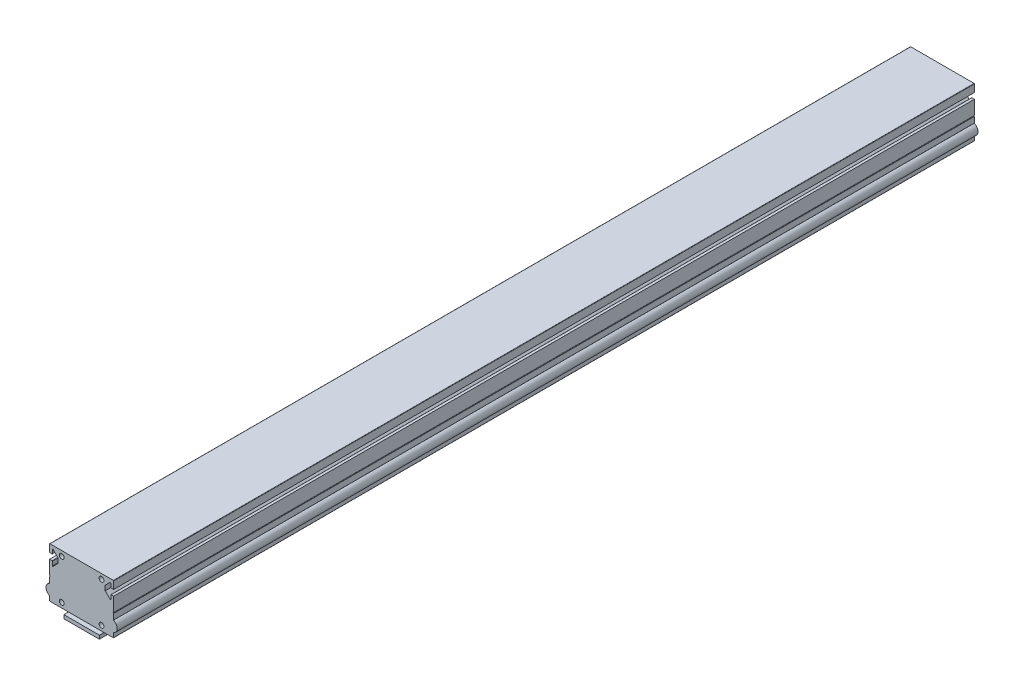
ISO-10303-21;
HEADER;
FILE_DESCRIPTION(('STEP AP214'),'2;1');
FILE_NAME('part.step','',(''),(''),'','','');
FILE_SCHEMA(('AUTOMOTIVE_DESIGN { 1 0 10303 214 1 1 1 1 }'));
ENDSEC;
DATA;
#1=APPLICATION_CONTEXT('core data for automotive mechanical design processes');
#2=APPLICATION_PROTOCOL_DEFINITION('international standard','automotive_design',2000,#1);
#3=PRODUCT_CONTEXT('',#1,'mechanical');
#4=PRODUCT('Part','Part','',(#3));
#5=PRODUCT_RELATED_PRODUCT_CATEGORY('part','',(#4));
#6=PRODUCT_DEFINITION_FORMATION('','',#4);
#7=PRODUCT_DEFINITION_CONTEXT('part definition',#1,'design');
#8=PRODUCT_DEFINITION('design','',#6,#7);
#9=PRODUCT_DEFINITION_SHAPE('','',#8);
#10=(LENGTH_UNIT() NAMED_UNIT(*) SI_UNIT(.MILLI.,.METRE.));
#11=(NAMED_UNIT(*) PLANE_ANGLE_UNIT() SI_UNIT($,.RADIAN.));
#12=(NAMED_UNIT(*) SI_UNIT($,.STERADIAN.) SOLID_ANGLE_UNIT());
#13=UNCERTAINTY_MEASURE_WITH_UNIT(LENGTH_MEASURE(1.E-05),#10,'distance_accuracy_value','');
#14=(GEOMETRIC_REPRESENTATION_CONTEXT(3) GLOBAL_UNCERTAINTY_ASSIGNED_CONTEXT((#13)) GLOBAL_UNIT_ASSIGNED_CONTEXT((#10,
#11,#12)) REPRESENTATION_CONTEXT('',''));
#15=CARTESIAN_POINT('',(0.,0.,0.));
#16=DIRECTION('',(0.,0.,1.));
#17=DIRECTION('',(1.,0.,0.));
#18=AXIS2_PLACEMENT_3D('',#15,#16,#17);
#19=CARTESIAN_POINT('',(25.,-41.5,1210.));
#20=DIRECTION('',(-1.,0.,0.));
#21=DIRECTION('',(0.,0.,1.));
#22=AXIS2_PLACEMENT_3D('',#19,#20,#21);
#23=PLANE('',#22);
#24=DIRECTION('',(0.,1.,0.));
#25=VECTOR('',#24,1.);
#26=CARTESIAN_POINT('',(25.,-41.5,0.));
#27=LINE('',#26,#25);
#28=CARTESIAN_POINT('',(25.,-46.5,0.));
#29=VERTEX_POINT('',#28);
#30=CARTESIAN_POINT('',(25.,-41.5,0.));
#31=VERTEX_POINT('',#30);
#32=EDGE_CURVE('E107',#29,#31,#27,.T.);
#33=ORIENTED_EDGE('',*,*,#32,.T.);
#34=DIRECTION('',(0.,0.,-1.));
#35=VECTOR('',#34,1.);
#36=CARTESIAN_POINT('',(25.,-41.5,1210.));
#37=LINE('',#36,#35);
#38=CARTESIAN_POINT('',(25.,-41.5,1210.));
#39=VERTEX_POINT('',#38);
#40=EDGE_CURVE('E12',#39,#31,#37,.T.);
#41=ORIENTED_EDGE('',*,*,#40,.F.);
#42=DIRECTION('',(0.,1.,0.));
#43=VECTOR('',#42,1.);
#44=CARTESIAN_POINT('',(25.,-41.5,1210.));
#45=LINE('',#44,#43);
#46=CARTESIAN_POINT('',(25.,-46.5,1210.));
#47=VERTEX_POINT('',#46);
#48=EDGE_CURVE('E95',#47,#39,#45,.T.);
#49=ORIENTED_EDGE('',*,*,#48,.F.);
#50=DIRECTION('',(0.,0.,-1.));
#51=VECTOR('',#50,1.);
#52=CARTESIAN_POINT('',(25.,-46.5,1210.));
#53=LINE('',#52,#51);
#54=EDGE_CURVE('E103',#47,#29,#53,.T.);
#55=ORIENTED_EDGE('',*,*,#54,.T.);
#56=EDGE_LOOP('',(#33,#41,#49,#55));
#57=FACE_BOUND('',#56,.T.);
#58=ADVANCED_FACE('F44',(#57),#23,.F.);
#59=CARTESIAN_POINT('',(-25.,-41.5,1210.));
#60=DIRECTION('',(0.,-1.,0.));
#61=DIRECTION('',(0.,0.,-1.));
#62=AXIS2_PLACEMENT_3D('',#59,#60,#61);
#63=PLANE('',#62);
#64=DIRECTION('',(-1.,0.,0.));
#65=VECTOR('',#64,1.);
#66=CARTESIAN_POINT('',(-25.,-41.5,0.));
#67=LINE('',#66,#65);
#68=CARTESIAN_POINT('',(-25.,-41.5,0.));
#69=VERTEX_POINT('',#68);
#70=EDGE_CURVE('E99',#31,#69,#67,.T.);
#71=ORIENTED_EDGE('',*,*,#70,.T.);
#72=DIRECTION('',(0.,0.,-1.));
#73=VECTOR('',#72,1.);
#74=CARTESIAN_POINT('',(-25.,-41.5,1210.));
#75=LINE('',#74,#73);
#76=CARTESIAN_POINT('',(-25.,-41.5,1210.));
#77=VERTEX_POINT('',#76);
#78=EDGE_CURVE('E52',#77,#69,#75,.T.);
#79=ORIENTED_EDGE('',*,*,#78,.F.);
#80=DIRECTION('',(-1.,0.,0.));
#81=VECTOR('',#80,1.);
#82=CARTESIAN_POINT('',(-25.,-41.5,1210.));
#83=LINE('',#82,#81);
#84=EDGE_CURVE('E90',#39,#77,#83,.T.);
#85=ORIENTED_EDGE('',*,*,#84,.F.);
#86=ORIENTED_EDGE('',*,*,#40,.T.);
#87=EDGE_LOOP('',(#71,#79,#85,#86));
#88=FACE_BOUND('',#87,.T.);
#89=ADVANCED_FACE('F98',(#88),#63,.F.);
#90=CARTESIAN_POINT('',(-25.,-41.5,1210.));
#91=DIRECTION('',(1.,0.,0.));
#92=DIRECTION('',(0.,0.,-1.));
#93=AXIS2_PLACEMENT_3D('',#90,#91,#92);
#94=PLANE('',#93);
#95=DIRECTION('',(0.,-1.,0.));
#96=VECTOR('',#95,1.);
#97=CARTESIAN_POINT('',(-25.,-41.5,0.));
#98=LINE('',#97,#96);
#99=CARTESIAN_POINT('',(-25.,-46.5,0.));
#100=VERTEX_POINT('',#99);
#101=EDGE_CURVE('E77',#69,#100,#98,.T.);
#102=ORIENTED_EDGE('',*,*,#101,.T.);
#103=DIRECTION('',(0.,0.,-1.));
#104=VECTOR('',#103,1.);
#105=CARTESIAN_POINT('',(-25.,-46.5,1210.));
#106=LINE('',#105,#104);
#107=CARTESIAN_POINT('',(-25.,-46.5,1210.));
#108=VERTEX_POINT('',#107);
#109=EDGE_CURVE('E100',#108,#100,#106,.T.);
#110=ORIENTED_EDGE('',*,*,#109,.F.);
#111=DIRECTION('',(0.,-1.,0.));
#112=VECTOR('',#111,1.);
#113=CARTESIAN_POINT('',(-25.,-41.5,1210.));
#114=LINE('',#113,#112);
#115=EDGE_CURVE('E93',#77,#108,#114,.T.);
#116=ORIENTED_EDGE('',*,*,#115,.F.);
#117=ORIENTED_EDGE('',*,*,#78,.T.);
#118=EDGE_LOOP('',(#102,#110,#116,#117));
#119=FACE_BOUND('',#118,.T.);
#120=ADVANCED_FACE('F101',(#119),#94,.F.);
#121=CARTESIAN_POINT('',(-25.,-46.5,1210.));
#122=DIRECTION('',(0.,1.,0.));
#123=DIRECTION('',(0.,0.,1.));
#124=AXIS2_PLACEMENT_3D('',#121,#122,#123);
#125=PLANE('',#124);
#126=DIRECTION('',(1.,0.,0.));
#127=VECTOR('',#126,1.);
#128=CARTESIAN_POINT('',(-25.,-46.5,0.));
#129=LINE('',#128,#127);
#130=EDGE_CURVE('E83',#100,#29,#129,.T.);
#131=ORIENTED_EDGE('',*,*,#130,.T.);
#132=ORIENTED_EDGE('',*,*,#54,.F.);
#133=DIRECTION('',(1.,0.,0.));
#134=VECTOR('',#133,1.);
#135=CARTESIAN_POINT('',(-25.,-46.5,1210.));
#136=LINE('',#135,#134);
#137=EDGE_CURVE('E60',#108,#47,#136,.T.);
#138=ORIENTED_EDGE('',*,*,#137,.F.);
#139=ORIENTED_EDGE('',*,*,#109,.T.);
#140=EDGE_LOOP('',(#131,#132,#138,#139));
#141=FACE_BOUND('',#140,.T.);
#142=ADVANCED_FACE('F114',(#141),#125,.F.);
#143=CARTESIAN_POINT('',(25.,-46.5,1210.));
#144=DIRECTION('',(0.,0.,1.));
#145=DIRECTION('',(1.,0.,0.));
#146=AXIS2_PLACEMENT_3D('',#143,#144,#145);
#147=PLANE('',#146);
#148=ORIENTED_EDGE('',*,*,#48,.T.);
#149=ORIENTED_EDGE('',*,*,#84,.T.);
#150=ORIENTED_EDGE('',*,*,#115,.T.);
#151=ORIENTED_EDGE('',*,*,#137,.T.);
#152=EDGE_LOOP('',(#148,#149,#150,#151));
#153=FACE_BOUND('',#152,.T.);
#154=ADVANCED_FACE('F91',(#153),#147,.T.);
#155=CARTESIAN_POINT('',(25.,-46.5,0.));
#156=DIRECTION('',(0.,0.,1.));
#157=DIRECTION('',(1.,0.,0.));
#158=AXIS2_PLACEMENT_3D('',#155,#156,#157);
#159=PLANE('',#158);
#160=ORIENTED_EDGE('',*,*,#32,.F.);
#161=ORIENTED_EDGE('',*,*,#130,.F.);
#162=ORIENTED_EDGE('',*,*,#101,.F.);
#163=ORIENTED_EDGE('',*,*,#70,.F.);
#164=EDGE_LOOP('',(#160,#161,#162,#163));
#165=FACE_BOUND('',#164,.T.);
#166=ADVANCED_FACE('F117',(#165),#159,.F.);
#167=CLOSED_SHELL('',(#58,#89,#120,#142,#154,#166));
#168=MANIFOLD_SOLID_BREP('B2',#167);
#169=CARTESIAN_POINT('',(-45.,35.,1210.));
#170=DIRECTION('',(0.,0.,1.));
#171=DIRECTION('',(1.,0.,0.));
#172=AXIS2_PLACEMENT_3D('',#169,#170,#171);
#173=PLANE('',#172);
#174=CARTESIAN_POINT('',(28.,28.,1210.));
#175=DIRECTION('',(0.,0.,-1.));
#176=DIRECTION('',(-1.,0.,0.));
#177=AXIS2_PLACEMENT_3D('',#174,#175,#176);
#178=CIRCLE('',#177,3.34999999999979);
#179=CARTESIAN_POINT('',(24.6500000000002,28.,1210.));
#180=VERTEX_POINT('',#179);
#181=EDGE_CURVE('E492',#180,#180,#178,.T.);
#182=ORIENTED_EDGE('',*,*,#181,.T.);
#183=EDGE_LOOP('',(#182));
#184=FACE_BOUND('',#183,.T.);
#185=CARTESIAN_POINT('',(-28.,-28.,1210.));
#186=DIRECTION('',(0.,0.,-1.));
#187=DIRECTION('',(-1.,0.,0.));
#188=AXIS2_PLACEMENT_3D('',#185,#186,#187);
#189=CIRCLE('',#188,3.34999999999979);
#190=CARTESIAN_POINT('',(-31.3499999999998,-28.,1210.));
#191=VERTEX_POINT('',#190);
#192=EDGE_CURVE('E570',#191,#191,#189,.T.);
#193=ORIENTED_EDGE('',*,*,#192,.T.);
#194=EDGE_LOOP('',(#193));
#195=FACE_BOUND('',#194,.T.);
#196=CARTESIAN_POINT('',(-28.,28.,1210.));
#197=DIRECTION('',(0.,0.,-1.));
#198=DIRECTION('',(-1.,0.,0.));
#199=AXIS2_PLACEMENT_3D('',#196,#197,#198);
#200=CIRCLE('',#199,3.34999999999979);
#201=CARTESIAN_POINT('',(-31.3499999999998,28.,1210.));
#202=VERTEX_POINT('',#201);
#203=EDGE_CURVE('E599',#202,#202,#200,.T.);
#204=ORIENTED_EDGE('',*,*,#203,.T.);
#205=EDGE_LOOP('',(#204));
#206=FACE_BOUND('',#205,.T.);
#207=DIRECTION('',(0.,1.,0.));
#208=VECTOR('',#207,1.);
#209=CARTESIAN_POINT('',(45.,35.,1210.));
#210=LINE('',#209,#208);
#211=CARTESIAN_POINT('',(45.,24.05,1210.));
#212=VERTEX_POINT('',#211);
#213=CARTESIAN_POINT('',(45.,34.5,1210.));
#214=VERTEX_POINT('',#213);
#215=EDGE_CURVE('E713',#212,#214,#210,.T.);
#216=ORIENTED_EDGE('',*,*,#215,.T.);
#217=CARTESIAN_POINT('',(44.5,34.5,1210.));
#218=DIRECTION('',(0.,0.,1.));
#219=DIRECTION('',(1.,0.,0.));
#220=AXIS2_PLACEMENT_3D('',#217,#218,#219);
#221=CIRCLE('',#220,0.5);
#222=CARTESIAN_POINT('',(44.5,35.,1210.));
#223=VERTEX_POINT('',#222);
#224=EDGE_CURVE('E781',#214,#223,#221,.T.);
#225=ORIENTED_EDGE('',*,*,#224,.T.);
#226=DIRECTION('',(-1.,0.,0.));
#227=VECTOR('',#226,1.);
#228=CARTESIAN_POINT('',(-45.,35.,1210.));
#229=LINE('',#228,#227);
#230=CARTESIAN_POINT('',(-44.5,35.,1210.));
#231=VERTEX_POINT('',#230);
#232=EDGE_CURVE('E716',#223,#231,#229,.T.);
#233=ORIENTED_EDGE('',*,*,#232,.T.);
#234=CARTESIAN_POINT('',(-44.5,34.5,1210.));
#235=DIRECTION('',(0.,0.,1.));
#236=DIRECTION('',(1.,0.,0.));
#237=AXIS2_PLACEMENT_3D('',#234,#235,#236);
#238=CIRCLE('',#237,0.5);
#239=CARTESIAN_POINT('',(-45.,34.5,1210.));
#240=VERTEX_POINT('',#239);
#241=EDGE_CURVE('E182',#231,#240,#238,.T.);
#242=ORIENTED_EDGE('',*,*,#241,.T.);
#243=DIRECTION('',(0.,-1.,0.));
#244=VECTOR('',#243,1.);
#245=CARTESIAN_POINT('',(-45.,35.,1210.));
#246=LINE('',#245,#244);
#247=CARTESIAN_POINT('',(-45.,24.05,1210.));
#248=VERTEX_POINT('',#247);
#249=EDGE_CURVE('E707',#240,#248,#246,.T.);
#250=ORIENTED_EDGE('',*,*,#249,.T.);
#251=DIRECTION('',(1.,0.,0.));
#252=VECTOR('',#251,1.);
#253=CARTESIAN_POINT('',(-45.,24.05,1210.));
#254=LINE('',#253,#252);
#255=CARTESIAN_POINT('',(-41.5,24.05,1210.));
#256=VERTEX_POINT('',#255);
#257=EDGE_CURVE('E616',#248,#256,#254,.T.);
#258=ORIENTED_EDGE('',*,*,#257,.T.);
#259=CARTESIAN_POINT('',(-41.5,24.55,1210.));
#260=DIRECTION('',(0.,0.,1.));
#261=DIRECTION('',(1.,0.,0.));
#262=AXIS2_PLACEMENT_3D('',#259,#260,#261);
#263=CIRCLE('',#262,0.500000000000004);
#264=CARTESIAN_POINT('',(-41.,24.55,1210.));
#265=VERTEX_POINT('',#264);
#266=EDGE_CURVE('E619',#256,#265,#263,.T.);
#267=ORIENTED_EDGE('',*,*,#266,.T.);
#268=DIRECTION('',(0.,1.,0.));
#269=VECTOR('',#268,1.);
#270=CARTESIAN_POINT('',(-41.,24.55,1210.));
#271=LINE('',#270,#269);
#272=CARTESIAN_POINT('',(-41.,30.,1210.));
#273=VERTEX_POINT('',#272);
#274=EDGE_CURVE('E623',#265,#273,#271,.T.);
#275=ORIENTED_EDGE('',*,*,#274,.T.);
#276=CARTESIAN_POINT('',(-40.5,30.,1210.));
#277=DIRECTION('',(0.,0.,-1.));
#278=DIRECTION('',(1.,0.,0.));
#279=AXIS2_PLACEMENT_3D('',#276,#277,#278);
#280=CIRCLE('',#279,0.499999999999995);
#281=CARTESIAN_POINT('',(-40.1464466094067,30.3535533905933,1210.));
#282=VERTEX_POINT('',#281);
#283=EDGE_CURVE('E626',#273,#282,#280,.T.);
#284=ORIENTED_EDGE('',*,*,#283,.T.);
#285=DIRECTION('',(0.707106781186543,-0.707106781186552,0.));
#286=VECTOR('',#285,1.);
#287=CARTESIAN_POINT('',(-40.1464466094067,30.3535533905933,1210.));
#288=LINE('',#287,#286);
#289=CARTESIAN_POINT('',(-33.2,23.4071067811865,1210.));
#290=VERTEX_POINT('',#289);
#291=EDGE_CURVE('E629',#282,#290,#288,.T.);
#292=ORIENTED_EDGE('',*,*,#291,.T.);
#293=DIRECTION('',(0.,-1.,0.));
#294=VECTOR('',#293,1.);
#295=CARTESIAN_POINT('',(-33.2,23.4071067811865,1210.));
#296=LINE('',#295,#294);
#297=CARTESIAN_POINT('',(-33.2,16.5928932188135,1210.));
#298=VERTEX_POINT('',#297);
#299=EDGE_CURVE('E632',#290,#298,#296,.T.);
#300=ORIENTED_EDGE('',*,*,#299,.T.);
#301=DIRECTION('',(-0.707106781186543,-0.707106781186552,0.));
#302=VECTOR('',#301,1.);
#303=CARTESIAN_POINT('',(-40.1464466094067,9.64644660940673,1210.));
#304=LINE('',#303,#302);
#305=CARTESIAN_POINT('',(-40.1464466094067,9.64644660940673,1210.));
#306=VERTEX_POINT('',#305);
#307=EDGE_CURVE('E635',#298,#306,#304,.T.);
#308=ORIENTED_EDGE('',*,*,#307,.T.);
#309=CARTESIAN_POINT('',(-40.5,10.,1210.));
#310=DIRECTION('',(0.,0.,-1.));
#311=DIRECTION('',(-1.,0.,0.));
#312=AXIS2_PLACEMENT_3D('',#309,#310,#311);
#313=CIRCLE('',#312,0.499999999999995);
#314=CARTESIAN_POINT('',(-41.,10.,1210.));
#315=VERTEX_POINT('',#314);
#316=EDGE_CURVE('E638',#306,#315,#313,.T.);
#317=ORIENTED_EDGE('',*,*,#316,.T.);
#318=DIRECTION('',(0.,1.,0.));
#319=VECTOR('',#318,1.);
#320=CARTESIAN_POINT('',(-41.,15.45,1210.));
#321=LINE('',#320,#319);
#322=CARTESIAN_POINT('',(-41.,15.45,1210.));
#323=VERTEX_POINT('',#322);
#324=EDGE_CURVE('E641',#315,#323,#321,.T.);
#325=ORIENTED_EDGE('',*,*,#324,.T.);
#326=CARTESIAN_POINT('',(-41.5,15.45,1210.));
#327=DIRECTION('',(0.,0.,1.));
#328=DIRECTION('',(-1.,0.,0.));
#329=AXIS2_PLACEMENT_3D('',#326,#327,#328);
#330=CIRCLE('',#329,0.500000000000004);
#331=CARTESIAN_POINT('',(-41.5,15.95,1210.));
#332=VERTEX_POINT('',#331);
#333=EDGE_CURVE('E644',#323,#332,#330,.T.);
#334=ORIENTED_EDGE('',*,*,#333,.T.);
#335=DIRECTION('',(-1.,0.,0.));
#336=VECTOR('',#335,1.);
#337=CARTESIAN_POINT('',(-45.,15.95,1210.));
#338=LINE('',#337,#336);
#339=CARTESIAN_POINT('',(-45.,15.95,1210.));
#340=VERTEX_POINT('',#339);
#341=EDGE_CURVE('E647',#332,#340,#338,.T.);
#342=ORIENTED_EDGE('',*,*,#341,.T.);
#343=CARTESIAN_POINT('',(-45.,-3.8,1210.));
#344=VERTEX_POINT('',#343);
#345=EDGE_CURVE('E710',#340,#344,#246,.T.);
#346=ORIENTED_EDGE('',*,*,#345,.T.);
#347=CARTESIAN_POINT('',(-45.,-4.4,1210.));
#348=DIRECTION('',(0.,0.,-1.));
#349=DIRECTION('',(-1.,0.,0.));
#350=AXIS2_PLACEMENT_3D('',#347,#348,#349);
#351=CIRCLE('',#350,0.6);
#352=CARTESIAN_POINT('',(-45.,-5.,1210.));
#353=VERTEX_POINT('',#352);
#354=EDGE_CURVE('E606',#344,#353,#351,.T.);
#355=ORIENTED_EDGE('',*,*,#354,.T.);
#356=CARTESIAN_POINT('',(-45.,-13.0985760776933,1210.));
#357=VERTEX_POINT('',#356);
#358=EDGE_CURVE('E802',#353,#357,#246,.T.);
#359=ORIENTED_EDGE('',*,*,#358,.T.);
#360=CARTESIAN_POINT('',(-44.7,-13.0985760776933,1210.));
#361=DIRECTION('',(0.,0.,1.));
#362=DIRECTION('',(1.,0.,0.));
#363=AXIS2_PLACEMENT_3D('',#360,#361,#362);
#364=CIRCLE('',#363,0.3);
#365=CARTESIAN_POINT('',(-44.602994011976,-13.3824595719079,1210.));
#366=VERTEX_POINT('',#365);
#367=EDGE_CURVE('E745',#357,#366,#364,.T.);
#368=ORIENTED_EDGE('',*,*,#367,.T.);
#369=CARTESIAN_POINT('',(-42.,-21.,1210.));
#370=DIRECTION('',(0.,0.,1.));
#371=DIRECTION('',(1.,0.,0.));
#372=AXIS2_PLACEMENT_3D('',#369,#370,#371);
#373=CIRCLE('',#372,8.05);
#374=CARTESIAN_POINT('',(-44.602994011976,-28.6175404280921,1210.));
#375=VERTEX_POINT('',#374);
#376=EDGE_CURVE('E469',#375,#366,#373,.F.);
#377=ORIENTED_EDGE('',*,*,#376,.F.);
#378=CARTESIAN_POINT('',(-44.7,-28.9014239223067,1210.));
#379=DIRECTION('',(0.,0.,1.));
#380=DIRECTION('',(1.,0.,0.));
#381=AXIS2_PLACEMENT_3D('',#378,#379,#380);
#382=CIRCLE('',#381,0.3);
#383=CARTESIAN_POINT('',(-45.,-28.9014239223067,1210.));
#384=VERTEX_POINT('',#383);
#385=EDGE_CURVE('E747',#375,#384,#382,.T.);
#386=ORIENTED_EDGE('',*,*,#385,.T.);
#387=CARTESIAN_POINT('',(-45.,-34.5,1210.));
#388=VERTEX_POINT('',#387);
#389=EDGE_CURVE('E711',#384,#388,#246,.T.);
#390=ORIENTED_EDGE('',*,*,#389,.T.);
#391=CARTESIAN_POINT('',(-44.5,-34.5,1210.));
#392=DIRECTION('',(0.,0.,1.));
#393=DIRECTION('',(1.,0.,0.));
#394=AXIS2_PLACEMENT_3D('',#391,#392,#393);
#395=CIRCLE('',#394,0.5);
#396=CARTESIAN_POINT('',(-44.5,-35.,1210.));
#397=VERTEX_POINT('',#396);
#398=EDGE_CURVE('E778',#388,#397,#395,.T.);
#399=ORIENTED_EDGE('',*,*,#398,.T.);
#400=DIRECTION('',(1.,0.,0.));
#401=VECTOR('',#400,1.);
#402=CARTESIAN_POINT('',(-45.,-35.,1210.));
#403=LINE('',#402,#401);
#404=CARTESIAN_POINT('',(44.5,-35.,1210.));
#405=VERTEX_POINT('',#404);
#406=EDGE_CURVE('E709',#397,#405,#403,.T.);
#407=ORIENTED_EDGE('',*,*,#406,.T.);
#408=CARTESIAN_POINT('',(44.5,-34.5,1210.));
#409=DIRECTION('',(0.,0.,1.));
#410=DIRECTION('',(1.,0.,0.));
#411=AXIS2_PLACEMENT_3D('',#408,#409,#410);
#412=CIRCLE('',#411,0.5);
#413=CARTESIAN_POINT('',(45.,-34.5,1210.));
#414=VERTEX_POINT('',#413);
#415=EDGE_CURVE('E189',#405,#414,#412,.T.);
#416=ORIENTED_EDGE('',*,*,#415,.T.);
#417=CARTESIAN_POINT('',(45.,-28.9014239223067,1210.));
#418=VERTEX_POINT('',#417);
#419=EDGE_CURVE('E714',#414,#418,#210,.T.);
#420=ORIENTED_EDGE('',*,*,#419,.T.);
#421=CARTESIAN_POINT('',(44.7,-28.9014239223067,1210.));
#422=DIRECTION('',(0.,0.,1.));
#423=DIRECTION('',(1.,0.,0.));
#424=AXIS2_PLACEMENT_3D('',#421,#422,#423);
#425=CIRCLE('',#424,0.3);
#426=CARTESIAN_POINT('',(44.6029940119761,-28.6175404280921,1210.));
#427=VERTEX_POINT('',#426);
#428=EDGE_CURVE('E743',#418,#427,#425,.T.);
#429=ORIENTED_EDGE('',*,*,#428,.T.);
#430=CARTESIAN_POINT('',(42.,-21.,1210.));
#431=DIRECTION('',(0.,0.,1.));
#432=DIRECTION('',(1.,0.,0.));
#433=AXIS2_PLACEMENT_3D('',#430,#431,#432);
#434=CIRCLE('',#433,8.05);
#435=CARTESIAN_POINT('',(44.6029940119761,-13.3824595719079,1210.));
#436=VERTEX_POINT('',#435);
#437=EDGE_CURVE('E483',#436,#427,#434,.F.);
#438=ORIENTED_EDGE('',*,*,#437,.F.);
#439=CARTESIAN_POINT('',(44.7,-13.0985760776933,1210.));
#440=DIRECTION('',(0.,0.,1.));
#441=DIRECTION('',(1.,0.,0.));
#442=AXIS2_PLACEMENT_3D('',#439,#440,#441);
#443=CIRCLE('',#442,0.3);
#444=CARTESIAN_POINT('',(45.,-13.0985760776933,1210.));
#445=VERTEX_POINT('',#444);
#446=EDGE_CURVE('E741',#436,#445,#443,.T.);
#447=ORIENTED_EDGE('',*,*,#446,.T.);
#448=CARTESIAN_POINT('',(45.,-5.,1210.));
#449=VERTEX_POINT('',#448);
#450=EDGE_CURVE('E717',#445,#449,#210,.T.);
#451=ORIENTED_EDGE('',*,*,#450,.T.);
#452=CARTESIAN_POINT('',(45.,-4.4,1210.));
#453=DIRECTION('',(0.,0.,1.));
#454=DIRECTION('',(1.,0.,0.));
#455=AXIS2_PLACEMENT_3D('',#452,#453,#454);
#456=CIRCLE('',#455,0.6);
#457=CARTESIAN_POINT('',(45.,-3.8,1210.));
#458=VERTEX_POINT('',#457);
#459=EDGE_CURVE('E499',#458,#449,#456,.T.);
#460=ORIENTED_EDGE('',*,*,#459,.F.);
#461=CARTESIAN_POINT('',(45.,15.95,1210.));
#462=VERTEX_POINT('',#461);
#463=EDGE_CURVE('E834',#458,#462,#210,.T.);
#464=ORIENTED_EDGE('',*,*,#463,.T.);
#465=DIRECTION('',(1.,0.,0.));
#466=VECTOR('',#465,1.);
#467=CARTESIAN_POINT('',(45.,15.95,1210.));
#468=LINE('',#467,#466);
#469=CARTESIAN_POINT('',(41.5,15.95,1210.));
#470=VERTEX_POINT('',#469);
#471=EDGE_CURVE('E513',#470,#462,#468,.T.);
#472=ORIENTED_EDGE('',*,*,#471,.F.);
#473=CARTESIAN_POINT('',(41.5,15.45,1210.));
#474=DIRECTION('',(0.,0.,-1.));
#475=DIRECTION('',(1.,0.,0.));
#476=AXIS2_PLACEMENT_3D('',#473,#474,#475);
#477=CIRCLE('',#476,0.500000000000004);
#478=CARTESIAN_POINT('',(41.,15.45,1210.));
#479=VERTEX_POINT('',#478);
#480=EDGE_CURVE('E517',#479,#470,#477,.T.);
#481=ORIENTED_EDGE('',*,*,#480,.F.);
#482=DIRECTION('',(0.,1.,0.));
#483=VECTOR('',#482,1.);
#484=CARTESIAN_POINT('',(41.,15.45,1210.));
#485=LINE('',#484,#483);
#486=CARTESIAN_POINT('',(41.,10.,1210.));
#487=VERTEX_POINT('',#486);
#488=EDGE_CURVE('E519',#487,#479,#485,.T.);
#489=ORIENTED_EDGE('',*,*,#488,.F.);
#490=CARTESIAN_POINT('',(40.5,10.,1210.));
#491=DIRECTION('',(0.,0.,1.));
#492=DIRECTION('',(1.,0.,0.));
#493=AXIS2_PLACEMENT_3D('',#490,#491,#492);
#494=CIRCLE('',#493,0.499999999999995);
#495=CARTESIAN_POINT('',(40.1464466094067,9.64644660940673,1210.));
#496=VERTEX_POINT('',#495);
#497=EDGE_CURVE('E521',#496,#487,#494,.T.);
#498=ORIENTED_EDGE('',*,*,#497,.F.);
#499=DIRECTION('',(0.707106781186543,-0.707106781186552,0.));
#500=VECTOR('',#499,1.);
#501=CARTESIAN_POINT('',(40.1464466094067,9.64644660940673,1210.));
#502=LINE('',#501,#500);
#503=CARTESIAN_POINT('',(33.2,16.5928932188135,1210.));
#504=VERTEX_POINT('',#503);
#505=EDGE_CURVE('E523',#504,#496,#502,.T.);
#506=ORIENTED_EDGE('',*,*,#505,.F.);
#507=DIRECTION('',(0.,-1.,0.));
#508=VECTOR('',#507,1.);
#509=CARTESIAN_POINT('',(33.2,23.4071067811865,1210.));
#510=LINE('',#509,#508);
#511=CARTESIAN_POINT('',(33.2,23.4071067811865,1210.));
#512=VERTEX_POINT('',#511);
#513=EDGE_CURVE('E525',#512,#504,#510,.T.);
#514=ORIENTED_EDGE('',*,*,#513,.F.);
#515=DIRECTION('',(-0.707106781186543,-0.707106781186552,0.));
#516=VECTOR('',#515,1.);
#517=CARTESIAN_POINT('',(40.1464466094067,30.3535533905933,1210.));
#518=LINE('',#517,#516);
#519=CARTESIAN_POINT('',(40.1464466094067,30.3535533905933,1210.));
#520=VERTEX_POINT('',#519);
#521=EDGE_CURVE('E527',#520,#512,#518,.T.);
#522=ORIENTED_EDGE('',*,*,#521,.F.);
#523=CARTESIAN_POINT('',(40.5,30.,1210.));
#524=DIRECTION('',(0.,0.,1.));
#525=DIRECTION('',(-1.,0.,0.));
#526=AXIS2_PLACEMENT_3D('',#523,#524,#525);
#527=CIRCLE('',#526,0.499999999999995);
#528=CARTESIAN_POINT('',(41.,30.,1210.));
#529=VERTEX_POINT('',#528);
#530=EDGE_CURVE('E529',#529,#520,#527,.T.);
#531=ORIENTED_EDGE('',*,*,#530,.F.);
#532=DIRECTION('',(0.,1.,0.));
#533=VECTOR('',#532,1.);
#534=CARTESIAN_POINT('',(41.,24.55,1210.));
#535=LINE('',#534,#533);
#536=CARTESIAN_POINT('',(41.,24.55,1210.));
#537=VERTEX_POINT('',#536);
#538=EDGE_CURVE('E531',#537,#529,#535,.T.);
#539=ORIENTED_EDGE('',*,*,#538,.F.);
#540=CARTESIAN_POINT('',(41.5,24.55,1210.));
#541=DIRECTION('',(0.,0.,-1.));
#542=DIRECTION('',(-1.,0.,0.));
#543=AXIS2_PLACEMENT_3D('',#540,#541,#542);
#544=CIRCLE('',#543,0.500000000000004);
#545=CARTESIAN_POINT('',(41.5,24.05,1210.));
#546=VERTEX_POINT('',#545);
#547=EDGE_CURVE('E533',#546,#537,#544,.T.);
#548=ORIENTED_EDGE('',*,*,#547,.F.);
#549=DIRECTION('',(-1.,0.,0.));
#550=VECTOR('',#549,1.);
#551=CARTESIAN_POINT('',(45.,24.05,1210.));
#552=LINE('',#551,#550);
#553=EDGE_CURVE('E511',#212,#546,#552,.T.);
#554=ORIENTED_EDGE('',*,*,#553,.F.);
#555=EDGE_LOOP('',(#216,#225,#233,#242,#250,#258,#267,#275,#284,#292,#300,#308,#317,#325,#334,
#342,#346,#355,#359,#368,#377,#386,#390,#399,#407,#416,#420,#429,#438,#447,#451,#460,#464,#472,
#481,#489,#498,#506,#514,#522,#531,#539,#548,#554));
#556=FACE_BOUND('',#555,.T.);
#557=CARTESIAN_POINT('',(28.,-28.,1210.));
#558=DIRECTION('',(0.,0.,-1.));
#559=DIRECTION('',(-1.,0.,0.));
#560=AXIS2_PLACEMENT_3D('',#557,#558,#559);
#561=CIRCLE('',#560,3.34999999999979);
#562=CARTESIAN_POINT('',(24.6500000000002,-28.,1210.));
#563=VERTEX_POINT('',#562);
#564=EDGE_CURVE('E486',#563,#563,#561,.T.);
#565=ORIENTED_EDGE('',*,*,#564,.T.);
#566=EDGE_LOOP('',(#565));
#567=FACE_BOUND('',#566,.T.);
#568=ADVANCED_FACE('F167',(#184,#195,#206,#556,#567),#173,.T.);
#569=CARTESIAN_POINT('',(-45.,35.,0.));
#570=DIRECTION('',(0.,0.,1.));
#571=DIRECTION('',(1.,0.,0.));
#572=AXIS2_PLACEMENT_3D('',#569,#570,#571);
#573=PLANE('',#572);
#574=CARTESIAN_POINT('',(-28.,28.,0.));
#575=DIRECTION('',(0.,0.,-1.));
#576=DIRECTION('',(-1.,0.,0.));
#577=AXIS2_PLACEMENT_3D('',#574,#575,#576);
#578=CIRCLE('',#577,3.34999999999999);
#579=CARTESIAN_POINT('',(-31.35,28.,0.));
#580=VERTEX_POINT('',#579);
#581=EDGE_CURVE('E602',#580,#580,#578,.T.);
#582=ORIENTED_EDGE('',*,*,#581,.F.);
#583=EDGE_LOOP('',(#582));
#584=FACE_BOUND('',#583,.T.);
#585=CARTESIAN_POINT('',(-28.,-28.,0.));
#586=DIRECTION('',(0.,0.,-1.));
#587=DIRECTION('',(-1.,0.,0.));
#588=AXIS2_PLACEMENT_3D('',#585,#586,#587);
#589=CIRCLE('',#588,3.34999999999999);
#590=CARTESIAN_POINT('',(-31.35,-28.,0.));
#591=VERTEX_POINT('',#590);
#592=EDGE_CURVE('E596',#591,#591,#589,.T.);
#593=ORIENTED_EDGE('',*,*,#592,.F.);
#594=EDGE_LOOP('',(#593));
#595=FACE_BOUND('',#594,.T.);
#596=DIRECTION('',(-1.,0.,0.));
#597=VECTOR('',#596,1.);
#598=CARTESIAN_POINT('',(-45.,35.,0.));
#599=LINE('',#598,#597);
#600=CARTESIAN_POINT('',(44.5,35.,0.));
#601=VERTEX_POINT('',#600);
#602=CARTESIAN_POINT('',(-44.5,35.,0.));
#603=VERTEX_POINT('',#602);
#604=EDGE_CURVE('E729',#601,#603,#599,.T.);
#605=ORIENTED_EDGE('',*,*,#604,.F.);
#606=CARTESIAN_POINT('',(44.5,34.5,0.));
#607=DIRECTION('',(0.,0.,1.));
#608=DIRECTION('',(1.,0.,0.));
#609=AXIS2_PLACEMENT_3D('',#606,#607,#608);
#610=CIRCLE('',#609,0.5);
#611=CARTESIAN_POINT('',(45.,34.5,0.));
#612=VERTEX_POINT('',#611);
#613=EDGE_CURVE('E773',#601,#612,#610,.F.);
#614=ORIENTED_EDGE('',*,*,#613,.T.);
#615=DIRECTION('',(0.,1.,0.));
#616=VECTOR('',#615,1.);
#617=CARTESIAN_POINT('',(45.,35.,0.));
#618=LINE('',#617,#616);
#619=CARTESIAN_POINT('',(45.,24.05,0.));
#620=VERTEX_POINT('',#619);
#621=EDGE_CURVE('E726',#620,#612,#618,.T.);
#622=ORIENTED_EDGE('',*,*,#621,.F.);
#623=DIRECTION('',(-1.,0.,0.));
#624=VECTOR('',#623,1.);
#625=CARTESIAN_POINT('',(45.,24.05,0.));
#626=LINE('',#625,#624);
#627=CARTESIAN_POINT('',(41.5,24.05,0.));
#628=VERTEX_POINT('',#627);
#629=EDGE_CURVE('E508',#620,#628,#626,.T.);
#630=ORIENTED_EDGE('',*,*,#629,.T.);
#631=CARTESIAN_POINT('',(41.5,24.55,0.));
#632=DIRECTION('',(0.,0.,-1.));
#633=DIRECTION('',(-1.,0.,0.));
#634=AXIS2_PLACEMENT_3D('',#631,#632,#633);
#635=CIRCLE('',#634,0.500000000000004);
#636=CARTESIAN_POINT('',(41.,24.55,0.));
#637=VERTEX_POINT('',#636);
#638=EDGE_CURVE('E514',#628,#637,#635,.T.);
#639=ORIENTED_EDGE('',*,*,#638,.T.);
#640=DIRECTION('',(0.,1.,0.));
#641=VECTOR('',#640,1.);
#642=CARTESIAN_POINT('',(41.,24.55,0.));
#643=LINE('',#642,#641);
#644=CARTESIAN_POINT('',(41.,30.,0.));
#645=VERTEX_POINT('',#644);
#646=EDGE_CURVE('E562',#637,#645,#643,.T.);
#647=ORIENTED_EDGE('',*,*,#646,.T.);
#648=CARTESIAN_POINT('',(40.5,30.,0.));
#649=DIRECTION('',(0.,0.,1.));
#650=DIRECTION('',(-1.,0.,0.));
#651=AXIS2_PLACEMENT_3D('',#648,#649,#650);
#652=CIRCLE('',#651,0.499999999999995);
#653=CARTESIAN_POINT('',(40.1464466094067,30.3535533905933,0.));
#654=VERTEX_POINT('',#653);
#655=EDGE_CURVE('E559',#645,#654,#652,.T.);
#656=ORIENTED_EDGE('',*,*,#655,.T.);
#657=DIRECTION('',(-0.707106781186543,-0.707106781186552,0.));
#658=VECTOR('',#657,1.);
#659=CARTESIAN_POINT('',(40.1464466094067,30.3535533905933,0.));
#660=LINE('',#659,#658);
#661=CARTESIAN_POINT('',(33.2,23.4071067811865,0.));
#662=VERTEX_POINT('',#661);
#663=EDGE_CURVE('E556',#654,#662,#660,.T.);
#664=ORIENTED_EDGE('',*,*,#663,.T.);
#665=DIRECTION('',(0.,-1.,0.));
#666=VECTOR('',#665,1.);
#667=CARTESIAN_POINT('',(33.2,23.4071067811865,0.));
#668=LINE('',#667,#666);
#669=CARTESIAN_POINT('',(33.2,16.5928932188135,0.));
#670=VERTEX_POINT('',#669);
#671=EDGE_CURVE('E553',#662,#670,#668,.T.);
#672=ORIENTED_EDGE('',*,*,#671,.T.);
#673=DIRECTION('',(0.707106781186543,-0.707106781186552,0.));
#674=VECTOR('',#673,1.);
#675=CARTESIAN_POINT('',(40.1464466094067,9.64644660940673,0.));
#676=LINE('',#675,#674);
#677=CARTESIAN_POINT('',(40.1464466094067,9.64644660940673,0.));
#678=VERTEX_POINT('',#677);
#679=EDGE_CURVE('E550',#670,#678,#676,.T.);
#680=ORIENTED_EDGE('',*,*,#679,.T.);
#681=CARTESIAN_POINT('',(40.5,10.,0.));
#682=DIRECTION('',(0.,0.,1.));
#683=DIRECTION('',(1.,0.,0.));
#684=AXIS2_PLACEMENT_3D('',#681,#682,#683);
#685=CIRCLE('',#684,0.499999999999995);
#686=CARTESIAN_POINT('',(41.,10.,0.));
#687=VERTEX_POINT('',#686);
#688=EDGE_CURVE('E547',#678,#687,#685,.T.);
#689=ORIENTED_EDGE('',*,*,#688,.T.);
#690=DIRECTION('',(0.,1.,0.));
#691=VECTOR('',#690,1.);
#692=CARTESIAN_POINT('',(41.,15.45,0.));
#693=LINE('',#692,#691);
#694=CARTESIAN_POINT('',(41.,15.45,0.));
#695=VERTEX_POINT('',#694);
#696=EDGE_CURVE('E544',#687,#695,#693,.T.);
#697=ORIENTED_EDGE('',*,*,#696,.T.);
#698=CARTESIAN_POINT('',(41.5,15.45,0.));
#699=DIRECTION('',(0.,0.,-1.));
#700=DIRECTION('',(1.,0.,0.));
#701=AXIS2_PLACEMENT_3D('',#698,#699,#700);
#702=CIRCLE('',#701,0.500000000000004);
#703=CARTESIAN_POINT('',(41.5,15.95,0.));
#704=VERTEX_POINT('',#703);
#705=EDGE_CURVE('E541',#695,#704,#702,.T.);
#706=ORIENTED_EDGE('',*,*,#705,.T.);
#707=DIRECTION('',(1.,0.,0.));
#708=VECTOR('',#707,1.);
#709=CARTESIAN_POINT('',(45.,15.95,0.));
#710=LINE('',#709,#708);
#711=CARTESIAN_POINT('',(45.,15.95,0.));
#712=VERTEX_POINT('',#711);
#713=EDGE_CURVE('E538',#704,#712,#710,.T.);
#714=ORIENTED_EDGE('',*,*,#713,.T.);
#715=CARTESIAN_POINT('',(45.,-3.8,0.));
#716=VERTEX_POINT('',#715);
#717=EDGE_CURVE('E1362',#716,#712,#618,.T.);
#718=ORIENTED_EDGE('',*,*,#717,.F.);
#719=CARTESIAN_POINT('',(45.,-4.4,0.));
#720=DIRECTION('',(0.,0.,1.));
#721=DIRECTION('',(1.,0.,0.));
#722=AXIS2_PLACEMENT_3D('',#719,#720,#721);
#723=CIRCLE('',#722,0.6);
#724=CARTESIAN_POINT('',(45.,-5.,0.));
#725=VERTEX_POINT('',#724);
#726=EDGE_CURVE('E498',#716,#725,#723,.T.);
#727=ORIENTED_EDGE('',*,*,#726,.T.);
#728=CARTESIAN_POINT('',(45.,-13.0985760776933,0.));
#729=VERTEX_POINT('',#728);
#730=EDGE_CURVE('E730',#729,#725,#618,.T.);
#731=ORIENTED_EDGE('',*,*,#730,.F.);
#732=CARTESIAN_POINT('',(44.7,-13.0985760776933,0.));
#733=DIRECTION('',(0.,0.,1.));
#734=DIRECTION('',(1.,0.,0.));
#735=AXIS2_PLACEMENT_3D('',#732,#733,#734);
#736=CIRCLE('',#735,0.3);
#737=CARTESIAN_POINT('',(44.6029940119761,-13.382459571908,0.));
#738=VERTEX_POINT('',#737);
#739=EDGE_CURVE('E735',#729,#738,#736,.F.);
#740=ORIENTED_EDGE('',*,*,#739,.T.);
#741=CARTESIAN_POINT('',(42.,-21.,0.));
#742=DIRECTION('',(0.,0.,-1.));
#743=DIRECTION('',(-1.,0.,0.));
#744=AXIS2_PLACEMENT_3D('',#741,#742,#743);
#745=CIRCLE('',#744,8.05);
#746=CARTESIAN_POINT('',(44.6029940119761,-28.6175404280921,0.));
#747=VERTEX_POINT('',#746);
#748=EDGE_CURVE('E478',#738,#747,#745,.T.);
#749=ORIENTED_EDGE('',*,*,#748,.T.);
#750=CARTESIAN_POINT('',(44.7,-28.9014239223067,0.));
#751=DIRECTION('',(0.,0.,1.));
#752=DIRECTION('',(1.,0.,0.));
#753=AXIS2_PLACEMENT_3D('',#750,#751,#752);
#754=CIRCLE('',#753,0.3);
#755=CARTESIAN_POINT('',(45.,-28.9014239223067,0.));
#756=VERTEX_POINT('',#755);
#757=EDGE_CURVE('E461',#747,#756,#754,.F.);
#758=ORIENTED_EDGE('',*,*,#757,.T.);
#759=CARTESIAN_POINT('',(45.,-34.5,0.));
#760=VERTEX_POINT('',#759);
#761=EDGE_CURVE('E727',#760,#756,#618,.T.);
#762=ORIENTED_EDGE('',*,*,#761,.F.);
#763=CARTESIAN_POINT('',(44.5,-34.5,0.));
#764=DIRECTION('',(0.,0.,1.));
#765=DIRECTION('',(1.,0.,0.));
#766=AXIS2_PLACEMENT_3D('',#763,#764,#765);
#767=CIRCLE('',#766,0.5);
#768=CARTESIAN_POINT('',(44.5,-35.,0.));
#769=VERTEX_POINT('',#768);
#770=EDGE_CURVE('E771',#760,#769,#767,.F.);
#771=ORIENTED_EDGE('',*,*,#770,.T.);
#772=DIRECTION('',(1.,0.,0.));
#773=VECTOR('',#772,1.);
#774=CARTESIAN_POINT('',(-45.,-35.,0.));
#775=LINE('',#774,#773);
#776=CARTESIAN_POINT('',(-44.5,-35.,0.));
#777=VERTEX_POINT('',#776);
#778=EDGE_CURVE('E722',#777,#769,#775,.T.);
#779=ORIENTED_EDGE('',*,*,#778,.F.);
#780=CARTESIAN_POINT('',(-44.5,-34.5,0.));
#781=DIRECTION('',(0.,0.,1.));
#782=DIRECTION('',(1.,0.,0.));
#783=AXIS2_PLACEMENT_3D('',#780,#781,#782);
#784=CIRCLE('',#783,0.5);
#785=CARTESIAN_POINT('',(-45.,-34.5,0.));
#786=VERTEX_POINT('',#785);
#787=EDGE_CURVE('E769',#777,#786,#784,.F.);
#788=ORIENTED_EDGE('',*,*,#787,.T.);
#789=DIRECTION('',(0.,-1.,0.));
#790=VECTOR('',#789,1.);
#791=CARTESIAN_POINT('',(-45.,35.,0.));
#792=LINE('',#791,#790);
#793=CARTESIAN_POINT('',(-45.,-28.9014239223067,0.));
#794=VERTEX_POINT('',#793);
#795=EDGE_CURVE('E683',#794,#786,#792,.T.);
#796=ORIENTED_EDGE('',*,*,#795,.F.);
#797=CARTESIAN_POINT('',(-44.7,-28.9014239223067,0.));
#798=DIRECTION('',(0.,0.,1.));
#799=DIRECTION('',(1.,0.,0.));
#800=AXIS2_PLACEMENT_3D('',#797,#798,#799);
#801=CIRCLE('',#800,0.3);
#802=CARTESIAN_POINT('',(-44.602994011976,-28.6175404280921,0.));
#803=VERTEX_POINT('',#802);
#804=EDGE_CURVE('E460',#794,#803,#801,.F.);
#805=ORIENTED_EDGE('',*,*,#804,.T.);
#806=CARTESIAN_POINT('',(-42.,-21.,0.));
#807=DIRECTION('',(0.,0.,-1.));
#808=DIRECTION('',(-1.,0.,0.));
#809=AXIS2_PLACEMENT_3D('',#806,#807,#808);
#810=CIRCLE('',#809,8.05);
#811=CARTESIAN_POINT('',(-44.602994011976,-13.3824595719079,0.));
#812=VERTEX_POINT('',#811);
#813=EDGE_CURVE('E467',#803,#812,#810,.T.);
#814=ORIENTED_EDGE('',*,*,#813,.T.);
#815=CARTESIAN_POINT('',(-44.7,-13.0985760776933,0.));
#816=DIRECTION('',(0.,0.,1.));
#817=DIRECTION('',(1.,0.,0.));
#818=AXIS2_PLACEMENT_3D('',#815,#816,#817);
#819=CIRCLE('',#818,0.3);
#820=CARTESIAN_POINT('',(-45.,-13.0985760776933,0.));
#821=VERTEX_POINT('',#820);
#822=EDGE_CURVE('E449',#812,#821,#819,.F.);
#823=ORIENTED_EDGE('',*,*,#822,.T.);
#824=CARTESIAN_POINT('',(-45.,-5.,0.));
#825=VERTEX_POINT('',#824);
#826=EDGE_CURVE('E913',#825,#821,#792,.T.);
#827=ORIENTED_EDGE('',*,*,#826,.F.);
#828=CARTESIAN_POINT('',(-45.,-4.4,0.));
#829=DIRECTION('',(0.,0.,-1.));
#830=DIRECTION('',(-1.,0.,0.));
#831=AXIS2_PLACEMENT_3D('',#828,#829,#830);
#832=CIRCLE('',#831,0.6);
#833=CARTESIAN_POINT('',(-45.,-3.8,0.));
#834=VERTEX_POINT('',#833);
#835=EDGE_CURVE('E605',#834,#825,#832,.T.);
#836=ORIENTED_EDGE('',*,*,#835,.F.);
#837=CARTESIAN_POINT('',(-45.,15.95,0.));
#838=VERTEX_POINT('',#837);
#839=EDGE_CURVE('E723',#838,#834,#792,.T.);
#840=ORIENTED_EDGE('',*,*,#839,.F.);
#841=DIRECTION('',(-1.,0.,0.));
#842=VECTOR('',#841,1.);
#843=CARTESIAN_POINT('',(-45.,15.95,0.));
#844=LINE('',#843,#842);
#845=CARTESIAN_POINT('',(-41.5,15.95,0.));
#846=VERTEX_POINT('',#845);
#847=EDGE_CURVE('E620',#846,#838,#844,.T.);
#848=ORIENTED_EDGE('',*,*,#847,.F.);
#849=CARTESIAN_POINT('',(-41.5,15.45,0.));
#850=DIRECTION('',(0.,0.,1.));
#851=DIRECTION('',(-1.,0.,0.));
#852=AXIS2_PLACEMENT_3D('',#849,#850,#851);
#853=CIRCLE('',#852,0.500000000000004);
#854=CARTESIAN_POINT('',(-41.,15.45,0.));
#855=VERTEX_POINT('',#854);
#856=EDGE_CURVE('E676',#855,#846,#853,.T.);
#857=ORIENTED_EDGE('',*,*,#856,.F.);
#858=DIRECTION('',(0.,1.,0.));
#859=VECTOR('',#858,1.);
#860=CARTESIAN_POINT('',(-41.,15.45,0.));
#861=LINE('',#860,#859);
#862=CARTESIAN_POINT('',(-41.,10.,0.));
#863=VERTEX_POINT('',#862);
#864=EDGE_CURVE('E673',#863,#855,#861,.T.);
#865=ORIENTED_EDGE('',*,*,#864,.F.);
#866=CARTESIAN_POINT('',(-40.5,10.,0.));
#867=DIRECTION('',(0.,0.,-1.));
#868=DIRECTION('',(-1.,0.,0.));
#869=AXIS2_PLACEMENT_3D('',#866,#867,#868);
#870=CIRCLE('',#869,0.499999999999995);
#871=CARTESIAN_POINT('',(-40.1464466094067,9.64644660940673,0.));
#872=VERTEX_POINT('',#871);
#873=EDGE_CURVE('E670',#872,#863,#870,.T.);
#874=ORIENTED_EDGE('',*,*,#873,.F.);
#875=DIRECTION('',(-0.707106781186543,-0.707106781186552,0.));
#876=VECTOR('',#875,1.);
#877=CARTESIAN_POINT('',(-40.1464466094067,9.64644660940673,0.));
#878=LINE('',#877,#876);
#879=CARTESIAN_POINT('',(-33.2,16.5928932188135,0.));
#880=VERTEX_POINT('',#879);
#881=EDGE_CURVE('E667',#880,#872,#878,.T.);
#882=ORIENTED_EDGE('',*,*,#881,.F.);
#883=DIRECTION('',(0.,-1.,0.));
#884=VECTOR('',#883,1.);
#885=CARTESIAN_POINT('',(-33.2,23.4071067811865,0.));
#886=LINE('',#885,#884);
#887=CARTESIAN_POINT('',(-33.2,23.4071067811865,0.));
#888=VERTEX_POINT('',#887);
#889=EDGE_CURVE('E664',#888,#880,#886,.T.);
#890=ORIENTED_EDGE('',*,*,#889,.F.);
#891=DIRECTION('',(0.707106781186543,-0.707106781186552,0.));
#892=VECTOR('',#891,1.);
#893=CARTESIAN_POINT('',(-40.1464466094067,30.3535533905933,0.));
#894=LINE('',#893,#892);
#895=CARTESIAN_POINT('',(-40.1464466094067,30.3535533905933,0.));
#896=VERTEX_POINT('',#895);
#897=EDGE_CURVE('E661',#896,#888,#894,.T.);
#898=ORIENTED_EDGE('',*,*,#897,.F.);
#899=CARTESIAN_POINT('',(-40.5,30.,0.));
#900=DIRECTION('',(0.,0.,-1.));
#901=DIRECTION('',(1.,0.,0.));
#902=AXIS2_PLACEMENT_3D('',#899,#900,#901);
#903=CIRCLE('',#902,0.499999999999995);
#904=CARTESIAN_POINT('',(-41.,30.,0.));
#905=VERTEX_POINT('',#904);
#906=EDGE_CURVE('E658',#905,#896,#903,.T.);
#907=ORIENTED_EDGE('',*,*,#906,.F.);
#908=DIRECTION('',(0.,1.,0.));
#909=VECTOR('',#908,1.);
#910=CARTESIAN_POINT('',(-41.,24.55,0.));
#911=LINE('',#910,#909);
#912=CARTESIAN_POINT('',(-41.,24.55,0.));
#913=VERTEX_POINT('',#912);
#914=EDGE_CURVE('E655',#913,#905,#911,.T.);
#915=ORIENTED_EDGE('',*,*,#914,.F.);
#916=CARTESIAN_POINT('',(-41.5,24.55,0.));
#917=DIRECTION('',(0.,0.,1.));
#918=DIRECTION('',(1.,0.,0.));
#919=AXIS2_PLACEMENT_3D('',#916,#917,#918);
#920=CIRCLE('',#919,0.500000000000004);
#921=CARTESIAN_POINT('',(-41.5,24.05,0.));
#922=VERTEX_POINT('',#921);
#923=EDGE_CURVE('E652',#922,#913,#920,.T.);
#924=ORIENTED_EDGE('',*,*,#923,.F.);
#925=DIRECTION('',(1.,0.,0.));
#926=VECTOR('',#925,1.);
#927=CARTESIAN_POINT('',(-45.,24.05,0.));
#928=LINE('',#927,#926);
#929=CARTESIAN_POINT('',(-45.,24.05,0.));
#930=VERTEX_POINT('',#929);
#931=EDGE_CURVE('E613',#930,#922,#928,.T.);
#932=ORIENTED_EDGE('',*,*,#931,.F.);
#933=CARTESIAN_POINT('',(-45.,34.5,0.));
#934=VERTEX_POINT('',#933);
#935=EDGE_CURVE('E720',#934,#930,#792,.T.);
#936=ORIENTED_EDGE('',*,*,#935,.F.);
#937=CARTESIAN_POINT('',(-44.5,34.5,0.));
#938=DIRECTION('',(0.,0.,1.));
#939=DIRECTION('',(1.,0.,0.));
#940=AXIS2_PLACEMENT_3D('',#937,#938,#939);
#941=CIRCLE('',#940,0.5);
#942=EDGE_CURVE('E767',#934,#603,#941,.F.);
#943=ORIENTED_EDGE('',*,*,#942,.T.);
#944=EDGE_LOOP('',(#605,#614,#622,#630,#639,#647,#656,#664,#672,#680,#689,#697,#706,#714,#718,
#727,#731,#740,#749,#758,#762,#771,#779,#788,#796,#805,#814,#823,#827,#836,#840,#848,#857,#865,
#874,#882,#890,#898,#907,#915,#924,#932,#936,#943));
#945=FACE_BOUND('',#944,.T.);
#946=CARTESIAN_POINT('',(28.,28.,0.));
#947=DIRECTION('',(0.,0.,-1.));
#948=DIRECTION('',(-1.,0.,0.));
#949=AXIS2_PLACEMENT_3D('',#946,#947,#948);
#950=CIRCLE('',#949,3.34999999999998);
#951=CARTESIAN_POINT('',(24.65,28.,0.));
#952=VERTEX_POINT('',#951);
#953=EDGE_CURVE('E495',#952,#952,#950,.T.);
#954=ORIENTED_EDGE('',*,*,#953,.F.);
#955=EDGE_LOOP('',(#954));
#956=FACE_BOUND('',#955,.T.);
#957=CARTESIAN_POINT('',(28.,-28.,0.));
#958=DIRECTION('',(0.,0.,-1.));
#959=DIRECTION('',(-1.,0.,0.));
#960=AXIS2_PLACEMENT_3D('',#957,#958,#959);
#961=CIRCLE('',#960,3.34999999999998);
#962=CARTESIAN_POINT('',(24.65,-28.,0.));
#963=VERTEX_POINT('',#962);
#964=EDGE_CURVE('E489',#963,#963,#961,.T.);
#965=ORIENTED_EDGE('',*,*,#964,.F.);
#966=EDGE_LOOP('',(#965));
#967=FACE_BOUND('',#966,.T.);
#968=ADVANCED_FACE('F473',(#584,#595,#945,#956,#967),#573,.F.);
#969=CARTESIAN_POINT('',(45.,35.,1210.));
#970=DIRECTION('',(-1.,0.,0.));
#971=DIRECTION('',(0.,-1.,0.));
#972=AXIS2_PLACEMENT_3D('',#969,#970,#971);
#973=PLANE('',#972);
#974=DIRECTION('',(0.,0.,-1.));
#975=VECTOR('',#974,1.);
#976=CARTESIAN_POINT('',(45.,-3.8,1210.));
#977=LINE('',#976,#975);
#978=EDGE_CURVE('E502',#458,#716,#977,.T.);
#979=ORIENTED_EDGE('',*,*,#978,.T.);
#980=ORIENTED_EDGE('',*,*,#717,.T.);
#981=DIRECTION('',(0.,0.,-1.));
#982=VECTOR('',#981,1.);
#983=CARTESIAN_POINT('',(45.,15.95,1210.));
#984=LINE('',#983,#982);
#985=EDGE_CURVE('E589',#462,#712,#984,.T.);
#986=ORIENTED_EDGE('',*,*,#985,.F.);
#987=ORIENTED_EDGE('',*,*,#463,.F.);
#988=EDGE_LOOP('',(#979,#980,#986,#987));
#989=FACE_BOUND('',#988,.T.);
#990=ADVANCED_FACE('F935',(#989),#973,.F.);
#991=ORIENTED_EDGE('',*,*,#450,.F.);
#992=DIRECTION('',(0.,0.,1.));
#993=VECTOR('',#992,1.);
#994=CARTESIAN_POINT('',(45.,-13.0985760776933,0.));
#995=LINE('',#994,#993);
#996=EDGE_CURVE('E759',#445,#729,#995,.F.);
#997=ORIENTED_EDGE('',*,*,#996,.T.);
#998=ORIENTED_EDGE('',*,*,#730,.T.);
#999=DIRECTION('',(0.,0.,-1.));
#1000=VECTOR('',#999,1.);
#1001=CARTESIAN_POINT('',(45.,-5.,1210.));
#1002=LINE('',#1001,#1000);
#1003=EDGE_CURVE('E505',#449,#725,#1002,.T.);
#1004=ORIENTED_EDGE('',*,*,#1003,.F.);
#1005=EDGE_LOOP('',(#991,#997,#998,#1004));
#1006=FACE_BOUND('',#1005,.T.);
#1007=ADVANCED_FACE('F832',(#1006),#973,.F.);
#1008=ORIENTED_EDGE('',*,*,#419,.F.);
#1009=DIRECTION('',(0.,0.,-1.));
#1010=VECTOR('',#1009,1.);
#1011=CARTESIAN_POINT('',(45.,-34.5,1210.));
#1012=LINE('',#1011,#1010);
#1013=EDGE_CURVE('E783',#414,#760,#1012,.T.);
#1014=ORIENTED_EDGE('',*,*,#1013,.T.);
#1015=ORIENTED_EDGE('',*,*,#761,.T.);
#1016=DIRECTION('',(0.,0.,1.));
#1017=VECTOR('',#1016,1.);
#1018=CARTESIAN_POINT('',(45.,-28.9014239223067,1210.));
#1019=LINE('',#1018,#1017);
#1020=EDGE_CURVE('E756',#756,#418,#1019,.T.);
#1021=ORIENTED_EDGE('',*,*,#1020,.T.);
#1022=EDGE_LOOP('',(#1008,#1014,#1015,#1021));
#1023=FACE_BOUND('',#1022,.T.);
#1024=ADVANCED_FACE('F814',(#1023),#973,.F.);
#1025=ORIENTED_EDGE('',*,*,#621,.T.);
#1026=DIRECTION('',(0.,0.,-1.));
#1027=VECTOR('',#1026,1.);
#1028=CARTESIAN_POINT('',(45.,34.5,1210.));
#1029=LINE('',#1028,#1027);
#1030=EDGE_CURVE('E775',#612,#214,#1029,.F.);
#1031=ORIENTED_EDGE('',*,*,#1030,.T.);
#1032=ORIENTED_EDGE('',*,*,#215,.F.);
#1033=DIRECTION('',(0.,0.,-1.));
#1034=VECTOR('',#1033,1.);
#1035=CARTESIAN_POINT('',(45.,24.05,1210.));
#1036=LINE('',#1035,#1034);
#1037=EDGE_CURVE('E535',#212,#620,#1036,.T.);
#1038=ORIENTED_EDGE('',*,*,#1037,.T.);
#1039=EDGE_LOOP('',(#1025,#1031,#1032,#1038));
#1040=FACE_BOUND('',#1039,.T.);
#1041=ADVANCED_FACE('F943',(#1040),#973,.F.);
#1042=CARTESIAN_POINT('',(-45.,35.,1210.));
#1043=DIRECTION('',(1.,0.,0.));
#1044=DIRECTION('',(0.,1.,0.));
#1045=AXIS2_PLACEMENT_3D('',#1042,#1043,#1044);
#1046=PLANE('',#1045);
#1047=ORIENTED_EDGE('',*,*,#826,.T.);
#1048=DIRECTION('',(0.,0.,-1.));
#1049=VECTOR('',#1048,1.);
#1050=CARTESIAN_POINT('',(-45.,-13.0985760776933,1210.));
#1051=LINE('',#1050,#1049);
#1052=EDGE_CURVE('E455',#821,#357,#1051,.F.);
#1053=ORIENTED_EDGE('',*,*,#1052,.T.);
#1054=ORIENTED_EDGE('',*,*,#358,.F.);
#1055=DIRECTION('',(0.,0.,-1.));
#1056=VECTOR('',#1055,1.);
#1057=CARTESIAN_POINT('',(-45.,-5.,1210.));
#1058=LINE('',#1057,#1056);
#1059=EDGE_CURVE('E609',#353,#825,#1058,.T.);
#1060=ORIENTED_EDGE('',*,*,#1059,.T.);
#1061=EDGE_LOOP('',(#1047,#1053,#1054,#1060));
#1062=FACE_BOUND('',#1061,.T.);
#1063=ADVANCED_FACE('F912',(#1062),#1046,.F.);
#1064=ORIENTED_EDGE('',*,*,#795,.T.);
#1065=DIRECTION('',(0.,0.,-1.));
#1066=VECTOR('',#1065,1.);
#1067=CARTESIAN_POINT('',(-45.,-34.5,1210.));
#1068=LINE('',#1067,#1066);
#1069=EDGE_CURVE('E175',#786,#388,#1068,.F.);
#1070=ORIENTED_EDGE('',*,*,#1069,.T.);
#1071=ORIENTED_EDGE('',*,*,#389,.F.);
#1072=DIRECTION('',(0.,0.,-1.));
#1073=VECTOR('',#1072,1.);
#1074=CARTESIAN_POINT('',(-45.,-28.9014239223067,1210.));
#1075=LINE('',#1074,#1073);
#1076=EDGE_CURVE('E719',#384,#794,#1075,.T.);
#1077=ORIENTED_EDGE('',*,*,#1076,.T.);
#1078=EDGE_LOOP('',(#1064,#1070,#1071,#1077));
#1079=FACE_BOUND('',#1078,.T.);
#1080=ADVANCED_FACE('F795',(#1079),#1046,.F.);
#1081=ORIENTED_EDGE('',*,*,#249,.F.);
#1082=DIRECTION('',(0.,0.,-1.));
#1083=VECTOR('',#1082,1.);
#1084=CARTESIAN_POINT('',(-45.,34.5,1210.));
#1085=LINE('',#1084,#1083);
#1086=EDGE_CURVE('E42',#240,#934,#1085,.T.);
#1087=ORIENTED_EDGE('',*,*,#1086,.T.);
#1088=ORIENTED_EDGE('',*,*,#935,.T.);
#1089=DIRECTION('',(0.,0.,-1.));
#1090=VECTOR('',#1089,1.);
#1091=CARTESIAN_POINT('',(-45.,24.05,1210.));
#1092=LINE('',#1091,#1090);
#1093=EDGE_CURVE('E680',#248,#930,#1092,.T.);
#1094=ORIENTED_EDGE('',*,*,#1093,.F.);
#1095=EDGE_LOOP('',(#1081,#1087,#1088,#1094));
#1096=FACE_BOUND('',#1095,.T.);
#1097=ADVANCED_FACE('F857',(#1096),#1046,.F.);
#1098=ORIENTED_EDGE('',*,*,#839,.T.);
#1099=DIRECTION('',(0.,0.,-1.));
#1100=VECTOR('',#1099,1.);
#1101=CARTESIAN_POINT('',(-45.,-3.8,1210.));
#1102=LINE('',#1101,#1100);
#1103=EDGE_CURVE('E611',#344,#834,#1102,.T.);
#1104=ORIENTED_EDGE('',*,*,#1103,.F.);
#1105=ORIENTED_EDGE('',*,*,#345,.F.);
#1106=DIRECTION('',(0.,0.,-1.));
#1107=VECTOR('',#1106,1.);
#1108=CARTESIAN_POINT('',(-45.,15.95,1210.));
#1109=LINE('',#1108,#1107);
#1110=EDGE_CURVE('E684',#340,#838,#1109,.T.);
#1111=ORIENTED_EDGE('',*,*,#1110,.T.);
#1112=EDGE_LOOP('',(#1098,#1104,#1105,#1111));
#1113=FACE_BOUND('',#1112,.T.);
#1114=ADVANCED_FACE('F907',(#1113),#1046,.F.);
#1115=CARTESIAN_POINT('',(-45.,-35.,1210.));
#1116=DIRECTION('',(0.,1.,0.));
#1117=DIRECTION('',(0.,0.,1.));
#1118=AXIS2_PLACEMENT_3D('',#1115,#1116,#1117);
#1119=PLANE('',#1118);
#1120=ORIENTED_EDGE('',*,*,#778,.T.);
#1121=DIRECTION('',(0.,0.,-1.));
#1122=VECTOR('',#1121,1.);
#1123=CARTESIAN_POINT('',(44.5,-35.,1210.));
#1124=LINE('',#1123,#1122);
#1125=EDGE_CURVE('E789',#769,#405,#1124,.F.);
#1126=ORIENTED_EDGE('',*,*,#1125,.T.);
#1127=ORIENTED_EDGE('',*,*,#406,.F.);
#1128=DIRECTION('',(0.,0.,-1.));
#1129=VECTOR('',#1128,1.);
#1130=CARTESIAN_POINT('',(-44.5,-35.,1210.));
#1131=LINE('',#1130,#1129);
#1132=EDGE_CURVE('E786',#397,#777,#1131,.T.);
#1133=ORIENTED_EDGE('',*,*,#1132,.T.);
#1134=EDGE_LOOP('',(#1120,#1126,#1127,#1133));
#1135=FACE_BOUND('',#1134,.T.);
#1136=ADVANCED_FACE('F807',(#1135),#1119,.F.);
#1137=CARTESIAN_POINT('',(-45.,35.,1210.));
#1138=DIRECTION('',(0.,-1.,0.));
#1139=DIRECTION('',(0.,0.,-1.));
#1140=AXIS2_PLACEMENT_3D('',#1137,#1138,#1139);
#1141=PLANE('',#1140);
#1142=ORIENTED_EDGE('',*,*,#232,.F.);
#1143=DIRECTION('',(0.,0.,-1.));
#1144=VECTOR('',#1143,1.);
#1145=CARTESIAN_POINT('',(44.5,35.,1210.));
#1146=LINE('',#1145,#1144);
#1147=EDGE_CURVE('E764',#223,#601,#1146,.T.);
#1148=ORIENTED_EDGE('',*,*,#1147,.T.);
#1149=ORIENTED_EDGE('',*,*,#604,.T.);
#1150=DIRECTION('',(0.,0.,-1.));
#1151=VECTOR('',#1150,1.);
#1152=CARTESIAN_POINT('',(-44.5,35.,1210.));
#1153=LINE('',#1152,#1151);
#1154=EDGE_CURVE('E762',#603,#231,#1153,.F.);
#1155=ORIENTED_EDGE('',*,*,#1154,.T.);
#1156=EDGE_LOOP('',(#1142,#1148,#1149,#1155));
#1157=FACE_BOUND('',#1156,.T.);
#1158=ADVANCED_FACE('F848',(#1157),#1141,.F.);
#1159=CARTESIAN_POINT('',(-45.,24.05,1210.));
#1160=DIRECTION('',(0.,1.,0.));
#1161=DIRECTION('',(0.,0.,1.));
#1162=AXIS2_PLACEMENT_3D('',#1159,#1160,#1161);
#1163=PLANE('',#1162);
#1164=ORIENTED_EDGE('',*,*,#931,.T.);
#1165=DIRECTION('',(0.,0.,-1.));
#1166=VECTOR('',#1165,1.);
#1167=CARTESIAN_POINT('',(-41.5,24.05,1210.));
#1168=LINE('',#1167,#1166);
#1169=EDGE_CURVE('E650',#256,#922,#1168,.T.);
#1170=ORIENTED_EDGE('',*,*,#1169,.F.);
#1171=ORIENTED_EDGE('',*,*,#257,.F.);
#1172=ORIENTED_EDGE('',*,*,#1093,.T.);
#1173=EDGE_LOOP('',(#1164,#1170,#1171,#1172));
#1174=FACE_BOUND('',#1173,.T.);
#1175=ADVANCED_FACE('F861',(#1174),#1163,.F.);
#1176=CARTESIAN_POINT('',(-45.,15.95,1210.));
#1177=DIRECTION('',(0.,-1.,0.));
#1178=DIRECTION('',(0.,0.,-1.));
#1179=AXIS2_PLACEMENT_3D('',#1176,#1177,#1178);
#1180=PLANE('',#1179);
#1181=ORIENTED_EDGE('',*,*,#847,.T.);
#1182=ORIENTED_EDGE('',*,*,#1110,.F.);
#1183=ORIENTED_EDGE('',*,*,#341,.F.);
#1184=DIRECTION('',(0.,0.,-1.));
#1185=VECTOR('',#1184,1.);
#1186=CARTESIAN_POINT('',(-41.5,15.95,1210.));
#1187=LINE('',#1186,#1185);
#1188=EDGE_CURVE('E687',#332,#846,#1187,.T.);
#1189=ORIENTED_EDGE('',*,*,#1188,.T.);
#1190=EDGE_LOOP('',(#1181,#1182,#1183,#1189));
#1191=FACE_BOUND('',#1190,.T.);
#1192=ADVANCED_FACE('F901',(#1191),#1180,.F.);
#1193=CARTESIAN_POINT('',(-41.5,15.45,1210.));
#1194=DIRECTION('',(0.,0.,-1.));
#1195=DIRECTION('',(-1.,0.,0.));
#1196=AXIS2_PLACEMENT_3D('',#1193,#1194,#1195);
#1197=CYLINDRICAL_SURFACE('',#1196,0.500000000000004);
#1198=ORIENTED_EDGE('',*,*,#856,.T.);
#1199=ORIENTED_EDGE('',*,*,#1188,.F.);
#1200=ORIENTED_EDGE('',*,*,#333,.F.);
#1201=DIRECTION('',(0.,0.,-1.));
#1202=VECTOR('',#1201,1.);
#1203=CARTESIAN_POINT('',(-41.,15.45,1210.));
#1204=LINE('',#1203,#1202);
#1205=EDGE_CURVE('E689',#323,#855,#1204,.T.);
#1206=ORIENTED_EDGE('',*,*,#1205,.T.);
#1207=EDGE_LOOP('',(#1198,#1199,#1200,#1206));
#1208=FACE_BOUND('',#1207,.T.);
#1209=ADVANCED_FACE('F897',(#1208),#1197,.T.);
#1210=CARTESIAN_POINT('',(-41.,15.45,1210.));
#1211=DIRECTION('',(-1.,0.,0.));
#1212=DIRECTION('',(0.,0.,1.));
#1213=AXIS2_PLACEMENT_3D('',#1210,#1211,#1212);
#1214=PLANE('',#1213);
#1215=ORIENTED_EDGE('',*,*,#864,.T.);
#1216=ORIENTED_EDGE('',*,*,#1205,.F.);
#1217=ORIENTED_EDGE('',*,*,#324,.F.);
#1218=DIRECTION('',(0.,0.,-1.));
#1219=VECTOR('',#1218,1.);
#1220=CARTESIAN_POINT('',(-41.,10.,1210.));
#1221=LINE('',#1220,#1219);
#1222=EDGE_CURVE('E691',#315,#863,#1221,.T.);
#1223=ORIENTED_EDGE('',*,*,#1222,.T.);
#1224=EDGE_LOOP('',(#1215,#1216,#1217,#1223));
#1225=FACE_BOUND('',#1224,.T.);
#1226=ADVANCED_FACE('F893',(#1225),#1214,.F.);
#1227=CARTESIAN_POINT('',(-40.5,10.,1210.));
#1228=DIRECTION('',(0.,0.,-1.));
#1229=DIRECTION('',(-1.,0.,0.));
#1230=AXIS2_PLACEMENT_3D('',#1227,#1228,#1229);
#1231=CYLINDRICAL_SURFACE('',#1230,0.499999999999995);
#1232=ORIENTED_EDGE('',*,*,#873,.T.);
#1233=ORIENTED_EDGE('',*,*,#1222,.F.);
#1234=ORIENTED_EDGE('',*,*,#316,.F.);
#1235=DIRECTION('',(0.,0.,-1.));
#1236=VECTOR('',#1235,1.);
#1237=CARTESIAN_POINT('',(-40.1464466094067,9.64644660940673,1210.));
#1238=LINE('',#1237,#1236);
#1239=EDGE_CURVE('E693',#306,#872,#1238,.T.);
#1240=ORIENTED_EDGE('',*,*,#1239,.T.);
#1241=EDGE_LOOP('',(#1232,#1233,#1234,#1240));
#1242=FACE_BOUND('',#1241,.T.);
#1243=ADVANCED_FACE('F889',(#1242),#1231,.F.);
#1244=CARTESIAN_POINT('',(-40.1464466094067,9.64644660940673,1210.));
#1245=DIRECTION('',(0.707106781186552,-0.707106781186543,0.));
#1246=DIRECTION('',(0.707106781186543,0.707106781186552,0.));
#1247=AXIS2_PLACEMENT_3D('',#1244,#1245,#1246);
#1248=PLANE('',#1247);
#1249=ORIENTED_EDGE('',*,*,#881,.T.);
#1250=ORIENTED_EDGE('',*,*,#1239,.F.);
#1251=ORIENTED_EDGE('',*,*,#307,.F.);
#1252=DIRECTION('',(0.,0.,-1.));
#1253=VECTOR('',#1252,1.);
#1254=CARTESIAN_POINT('',(-33.2,16.5928932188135,1210.));
#1255=LINE('',#1254,#1253);
#1256=EDGE_CURVE('E695',#298,#880,#1255,.T.);
#1257=ORIENTED_EDGE('',*,*,#1256,.T.);
#1258=EDGE_LOOP('',(#1249,#1250,#1251,#1257));
#1259=FACE_BOUND('',#1258,.T.);
#1260=ADVANCED_FACE('F885',(#1259),#1248,.F.);
#1261=CARTESIAN_POINT('',(-33.2,23.4071067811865,1210.));
#1262=DIRECTION('',(1.,0.,0.));
#1263=DIRECTION('',(0.,0.,-1.));
#1264=AXIS2_PLACEMENT_3D('',#1261,#1262,#1263);
#1265=PLANE('',#1264);
#1266=ORIENTED_EDGE('',*,*,#889,.T.);
#1267=ORIENTED_EDGE('',*,*,#1256,.F.);
#1268=ORIENTED_EDGE('',*,*,#299,.F.);
#1269=DIRECTION('',(0.,0.,-1.));
#1270=VECTOR('',#1269,1.);
#1271=CARTESIAN_POINT('',(-33.2,23.4071067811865,1210.));
#1272=LINE('',#1271,#1270);
#1273=EDGE_CURVE('E697',#290,#888,#1272,.T.);
#1274=ORIENTED_EDGE('',*,*,#1273,.T.);
#1275=EDGE_LOOP('',(#1266,#1267,#1268,#1274));
#1276=FACE_BOUND('',#1275,.T.);
#1277=ADVANCED_FACE('F881',(#1276),#1265,.F.);
#1278=CARTESIAN_POINT('',(-40.1464466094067,30.3535533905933,1210.));
#1279=DIRECTION('',(0.707106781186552,0.707106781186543,0.));
#1280=DIRECTION('',(-0.707106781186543,0.707106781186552,0.));
#1281=AXIS2_PLACEMENT_3D('',#1278,#1279,#1280);
#1282=PLANE('',#1281);
#1283=ORIENTED_EDGE('',*,*,#897,.T.);
#1284=ORIENTED_EDGE('',*,*,#1273,.F.);
#1285=ORIENTED_EDGE('',*,*,#291,.F.);
#1286=DIRECTION('',(0.,0.,-1.));
#1287=VECTOR('',#1286,1.);
#1288=CARTESIAN_POINT('',(-40.1464466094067,30.3535533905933,1210.));
#1289=LINE('',#1288,#1287);
#1290=EDGE_CURVE('E699',#282,#896,#1289,.T.);
#1291=ORIENTED_EDGE('',*,*,#1290,.T.);
#1292=EDGE_LOOP('',(#1283,#1284,#1285,#1291));
#1293=FACE_BOUND('',#1292,.T.);
#1294=ADVANCED_FACE('F877',(#1293),#1282,.F.);
#1295=CARTESIAN_POINT('',(-40.5,30.,1210.));
#1296=DIRECTION('',(0.,0.,-1.));
#1297=DIRECTION('',(-1.,0.,0.));
#1298=AXIS2_PLACEMENT_3D('',#1295,#1296,#1297);
#1299=CYLINDRICAL_SURFACE('',#1298,0.499999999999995);
#1300=ORIENTED_EDGE('',*,*,#906,.T.);
#1301=ORIENTED_EDGE('',*,*,#1290,.F.);
#1302=ORIENTED_EDGE('',*,*,#283,.F.);
#1303=DIRECTION('',(0.,0.,-1.));
#1304=VECTOR('',#1303,1.);
#1305=CARTESIAN_POINT('',(-41.,30.,1210.));
#1306=LINE('',#1305,#1304);
#1307=EDGE_CURVE('E701',#273,#905,#1306,.T.);
#1308=ORIENTED_EDGE('',*,*,#1307,.T.);
#1309=EDGE_LOOP('',(#1300,#1301,#1302,#1308));
#1310=FACE_BOUND('',#1309,.T.);
#1311=ADVANCED_FACE('F873',(#1310),#1299,.F.);
#1312=CARTESIAN_POINT('',(-41.,24.55,1210.));
#1313=DIRECTION('',(-1.,0.,0.));
#1314=DIRECTION('',(0.,0.,1.));
#1315=AXIS2_PLACEMENT_3D('',#1312,#1313,#1314);
#1316=PLANE('',#1315);
#1317=ORIENTED_EDGE('',*,*,#914,.T.);
#1318=ORIENTED_EDGE('',*,*,#1307,.F.);
#1319=ORIENTED_EDGE('',*,*,#274,.F.);
#1320=DIRECTION('',(0.,0.,-1.));
#1321=VECTOR('',#1320,1.);
#1322=CARTESIAN_POINT('',(-41.,24.55,1210.));
#1323=LINE('',#1322,#1321);
#1324=EDGE_CURVE('E703',#265,#913,#1323,.T.);
#1325=ORIENTED_EDGE('',*,*,#1324,.T.);
#1326=EDGE_LOOP('',(#1317,#1318,#1319,#1325));
#1327=FACE_BOUND('',#1326,.T.);
#1328=ADVANCED_FACE('F869',(#1327),#1316,.F.);
#1329=CARTESIAN_POINT('',(-41.5,24.55,1210.));
#1330=DIRECTION('',(0.,0.,-1.));
#1331=DIRECTION('',(-1.,0.,0.));
#1332=AXIS2_PLACEMENT_3D('',#1329,#1330,#1331);
#1333=CYLINDRICAL_SURFACE('',#1332,0.500000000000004);
#1334=ORIENTED_EDGE('',*,*,#923,.T.);
#1335=ORIENTED_EDGE('',*,*,#1324,.F.);
#1336=ORIENTED_EDGE('',*,*,#266,.F.);
#1337=ORIENTED_EDGE('',*,*,#1169,.T.);
#1338=EDGE_LOOP('',(#1334,#1335,#1336,#1337));
#1339=FACE_BOUND('',#1338,.T.);
#1340=ADVANCED_FACE('F865',(#1339),#1333,.T.);
#1341=CARTESIAN_POINT('',(-45.,-4.4,1210.));
#1342=DIRECTION('',(0.,0.,-1.));
#1343=DIRECTION('',(-1.,0.,0.));
#1344=AXIS2_PLACEMENT_3D('',#1341,#1342,#1343);
#1345=CYLINDRICAL_SURFACE('',#1344,0.6);
#1346=ORIENTED_EDGE('',*,*,#835,.T.);
#1347=ORIENTED_EDGE('',*,*,#1059,.F.);
#1348=ORIENTED_EDGE('',*,*,#354,.F.);
#1349=ORIENTED_EDGE('',*,*,#1103,.T.);
#1350=EDGE_LOOP('',(#1346,#1347,#1348,#1349));
#1351=FACE_BOUND('',#1350,.T.);
#1352=ADVANCED_FACE('F916',(#1351),#1345,.F.);
#1353=CARTESIAN_POINT('',(-28.,28.,0.));
#1354=DIRECTION('',(0.,0.,-1.));
#1355=DIRECTION('',(-1.,0.,0.));
#1356=AXIS2_PLACEMENT_3D('',#1353,#1354,#1355);
#1357=CYLINDRICAL_SURFACE('',#1356,3.34999999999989);
#1358=ORIENTED_EDGE('',*,*,#203,.F.);
#1359=EDGE_LOOP('',(#1358));
#1360=FACE_BOUND('',#1359,.T.);
#1361=ORIENTED_EDGE('',*,*,#581,.T.);
#1362=EDGE_LOOP('',(#1361));
#1363=FACE_BOUND('',#1362,.T.);
#1364=ADVANCED_FACE('F918',(#1360,#1363),#1357,.F.);
#1365=CARTESIAN_POINT('',(-28.,-28.,0.));
#1366=DIRECTION('',(0.,0.,-1.));
#1367=DIRECTION('',(-1.,0.,0.));
#1368=AXIS2_PLACEMENT_3D('',#1365,#1366,#1367);
#1369=CYLINDRICAL_SURFACE('',#1368,3.34999999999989);
#1370=ORIENTED_EDGE('',*,*,#192,.F.);
#1371=EDGE_LOOP('',(#1370));
#1372=FACE_BOUND('',#1371,.T.);
#1373=ORIENTED_EDGE('',*,*,#592,.T.);
#1374=EDGE_LOOP('',(#1373));
#1375=FACE_BOUND('',#1374,.T.);
#1376=ADVANCED_FACE('F924',(#1372,#1375),#1369,.F.);
#1377=CARTESIAN_POINT('',(45.,24.05,1210.));
#1378=DIRECTION('',(0.,-1.,0.));
#1379=DIRECTION('',(0.,0.,-1.));
#1380=AXIS2_PLACEMENT_3D('',#1377,#1378,#1379);
#1381=PLANE('',#1380);
#1382=ORIENTED_EDGE('',*,*,#629,.F.);
#1383=ORIENTED_EDGE('',*,*,#1037,.F.);
#1384=ORIENTED_EDGE('',*,*,#553,.T.);
#1385=DIRECTION('',(0.,0.,-1.));
#1386=VECTOR('',#1385,1.);
#1387=CARTESIAN_POINT('',(41.5,24.05,1210.));
#1388=LINE('',#1387,#1386);
#1389=EDGE_CURVE('E567',#546,#628,#1388,.T.);
#1390=ORIENTED_EDGE('',*,*,#1389,.T.);
#1391=EDGE_LOOP('',(#1382,#1383,#1384,#1390));
#1392=FACE_BOUND('',#1391,.T.);
#1393=ADVANCED_FACE('F993',(#1392),#1381,.T.);
#1394=CARTESIAN_POINT('',(41.5,24.55,1210.));
#1395=DIRECTION('',(0.,0.,-1.));
#1396=DIRECTION('',(-1.,0.,0.));
#1397=AXIS2_PLACEMENT_3D('',#1394,#1395,#1396);
#1398=CYLINDRICAL_SURFACE('',#1397,0.500000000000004);
#1399=ORIENTED_EDGE('',*,*,#638,.F.);
#1400=ORIENTED_EDGE('',*,*,#1389,.F.);
#1401=ORIENTED_EDGE('',*,*,#547,.T.);
#1402=DIRECTION('',(0.,0.,-1.));
#1403=VECTOR('',#1402,1.);
#1404=CARTESIAN_POINT('',(41.,24.55,1210.));
#1405=LINE('',#1404,#1403);
#1406=EDGE_CURVE('E571',#537,#637,#1405,.T.);
#1407=ORIENTED_EDGE('',*,*,#1406,.T.);
#1408=EDGE_LOOP('',(#1399,#1400,#1401,#1407));
#1409=FACE_BOUND('',#1408,.T.);
#1410=ADVANCED_FACE('F989',(#1409),#1398,.T.);
#1411=CARTESIAN_POINT('',(41.,24.55,1210.));
#1412=DIRECTION('',(-1.,0.,0.));
#1413=DIRECTION('',(0.,0.,1.));
#1414=AXIS2_PLACEMENT_3D('',#1411,#1412,#1413);
#1415=PLANE('',#1414);
#1416=ORIENTED_EDGE('',*,*,#646,.F.);
#1417=ORIENTED_EDGE('',*,*,#1406,.F.);
#1418=ORIENTED_EDGE('',*,*,#538,.T.);
#1419=DIRECTION('',(0.,0.,-1.));
#1420=VECTOR('',#1419,1.);
#1421=CARTESIAN_POINT('',(41.,30.,1210.));
#1422=LINE('',#1421,#1420);
#1423=EDGE_CURVE('E573',#529,#645,#1422,.T.);
#1424=ORIENTED_EDGE('',*,*,#1423,.T.);
#1425=EDGE_LOOP('',(#1416,#1417,#1418,#1424));
#1426=FACE_BOUND('',#1425,.T.);
#1427=ADVANCED_FACE('F992',(#1426),#1415,.T.);
#1428=CARTESIAN_POINT('',(40.5,30.,1210.));
#1429=DIRECTION('',(0.,0.,-1.));
#1430=DIRECTION('',(-1.,0.,0.));
#1431=AXIS2_PLACEMENT_3D('',#1428,#1429,#1430);
#1432=CYLINDRICAL_SURFACE('',#1431,0.499999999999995);
#1433=ORIENTED_EDGE('',*,*,#655,.F.);
#1434=ORIENTED_EDGE('',*,*,#1423,.F.);
#1435=ORIENTED_EDGE('',*,*,#530,.T.);
#1436=DIRECTION('',(0.,0.,-1.));
#1437=VECTOR('',#1436,1.);
#1438=CARTESIAN_POINT('',(40.1464466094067,30.3535533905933,1210.));
#1439=LINE('',#1438,#1437);
#1440=EDGE_CURVE('E575',#520,#654,#1439,.T.);
#1441=ORIENTED_EDGE('',*,*,#1440,.T.);
#1442=EDGE_LOOP('',(#1433,#1434,#1435,#1441));
#1443=FACE_BOUND('',#1442,.T.);
#1444=ADVANCED_FACE('F997',(#1443),#1432,.F.);
#1445=CARTESIAN_POINT('',(40.1464466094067,30.3535533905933,1210.));
#1446=DIRECTION('',(0.707106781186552,-0.707106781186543,0.));
#1447=DIRECTION('',(0.707106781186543,0.707106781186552,0.));
#1448=AXIS2_PLACEMENT_3D('',#1445,#1446,#1447);
#1449=PLANE('',#1448);
#1450=ORIENTED_EDGE('',*,*,#663,.F.);
#1451=ORIENTED_EDGE('',*,*,#1440,.F.);
#1452=ORIENTED_EDGE('',*,*,#521,.T.);
#1453=DIRECTION('',(0.,0.,-1.));
#1454=VECTOR('',#1453,1.);
#1455=CARTESIAN_POINT('',(33.2,23.4071067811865,1210.));
#1456=LINE('',#1455,#1454);
#1457=EDGE_CURVE('E577',#512,#662,#1456,.T.);
#1458=ORIENTED_EDGE('',*,*,#1457,.T.);
#1459=EDGE_LOOP('',(#1450,#1451,#1452,#1458));
#1460=FACE_BOUND('',#1459,.T.);
#1461=ADVANCED_FACE('F1001',(#1460),#1449,.T.);
#1462=CARTESIAN_POINT('',(33.2,23.4071067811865,1210.));
#1463=DIRECTION('',(1.,0.,0.));
#1464=DIRECTION('',(0.,0.,-1.));
#1465=AXIS2_PLACEMENT_3D('',#1462,#1463,#1464);
#1466=PLANE('',#1465);
#1467=ORIENTED_EDGE('',*,*,#671,.F.);
#1468=ORIENTED_EDGE('',*,*,#1457,.F.);
#1469=ORIENTED_EDGE('',*,*,#513,.T.);
#1470=DIRECTION('',(0.,0.,-1.));
#1471=VECTOR('',#1470,1.);
#1472=CARTESIAN_POINT('',(33.2,16.5928932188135,1210.));
#1473=LINE('',#1472,#1471);
#1474=EDGE_CURVE('E579',#504,#670,#1473,.T.);
#1475=ORIENTED_EDGE('',*,*,#1474,.T.);
#1476=EDGE_LOOP('',(#1467,#1468,#1469,#1475));
#1477=FACE_BOUND('',#1476,.T.);
#1478=ADVANCED_FACE('F1005',(#1477),#1466,.T.);
#1479=CARTESIAN_POINT('',(40.1464466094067,9.64644660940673,1210.));
#1480=DIRECTION('',(0.707106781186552,0.707106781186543,0.));
#1481=DIRECTION('',(-0.707106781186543,0.707106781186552,0.));
#1482=AXIS2_PLACEMENT_3D('',#1479,#1480,#1481);
#1483=PLANE('',#1482);
#1484=ORIENTED_EDGE('',*,*,#679,.F.);
#1485=ORIENTED_EDGE('',*,*,#1474,.F.);
#1486=ORIENTED_EDGE('',*,*,#505,.T.);
#1487=DIRECTION('',(0.,0.,-1.));
#1488=VECTOR('',#1487,1.);
#1489=CARTESIAN_POINT('',(40.1464466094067,9.64644660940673,1210.));
#1490=LINE('',#1489,#1488);
#1491=EDGE_CURVE('E581',#496,#678,#1490,.T.);
#1492=ORIENTED_EDGE('',*,*,#1491,.T.);
#1493=EDGE_LOOP('',(#1484,#1485,#1486,#1492));
#1494=FACE_BOUND('',#1493,.T.);
#1495=ADVANCED_FACE('F1009',(#1494),#1483,.T.);
#1496=CARTESIAN_POINT('',(40.5,10.,1210.));
#1497=DIRECTION('',(0.,0.,-1.));
#1498=DIRECTION('',(-1.,0.,0.));
#1499=AXIS2_PLACEMENT_3D('',#1496,#1497,#1498);
#1500=CYLINDRICAL_SURFACE('',#1499,0.499999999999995);
#1501=ORIENTED_EDGE('',*,*,#688,.F.);
#1502=ORIENTED_EDGE('',*,*,#1491,.F.);
#1503=ORIENTED_EDGE('',*,*,#497,.T.);
#1504=DIRECTION('',(0.,0.,-1.));
#1505=VECTOR('',#1504,1.);
#1506=CARTESIAN_POINT('',(41.,10.,1210.));
#1507=LINE('',#1506,#1505);
#1508=EDGE_CURVE('E583',#487,#687,#1507,.T.);
#1509=ORIENTED_EDGE('',*,*,#1508,.T.);
#1510=EDGE_LOOP('',(#1501,#1502,#1503,#1509));
#1511=FACE_BOUND('',#1510,.T.);
#1512=ADVANCED_FACE('F1013',(#1511),#1500,.F.);
#1513=CARTESIAN_POINT('',(41.,15.45,1210.));
#1514=DIRECTION('',(-1.,0.,0.));
#1515=DIRECTION('',(0.,0.,1.));
#1516=AXIS2_PLACEMENT_3D('',#1513,#1514,#1515);
#1517=PLANE('',#1516);
#1518=ORIENTED_EDGE('',*,*,#696,.F.);
#1519=ORIENTED_EDGE('',*,*,#1508,.F.);
#1520=ORIENTED_EDGE('',*,*,#488,.T.);
#1521=DIRECTION('',(0.,0.,-1.));
#1522=VECTOR('',#1521,1.);
#1523=CARTESIAN_POINT('',(41.,15.45,1210.));
#1524=LINE('',#1523,#1522);
#1525=EDGE_CURVE('E585',#479,#695,#1524,.T.);
#1526=ORIENTED_EDGE('',*,*,#1525,.T.);
#1527=EDGE_LOOP('',(#1518,#1519,#1520,#1526));
#1528=FACE_BOUND('',#1527,.T.);
#1529=ADVANCED_FACE('F1017',(#1528),#1517,.T.);
#1530=CARTESIAN_POINT('',(41.5,15.45,1210.));
#1531=DIRECTION('',(0.,0.,-1.));
#1532=DIRECTION('',(-1.,0.,0.));
#1533=AXIS2_PLACEMENT_3D('',#1530,#1531,#1532);
#1534=CYLINDRICAL_SURFACE('',#1533,0.500000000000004);
#1535=ORIENTED_EDGE('',*,*,#705,.F.);
#1536=ORIENTED_EDGE('',*,*,#1525,.F.);
#1537=ORIENTED_EDGE('',*,*,#480,.T.);
#1538=DIRECTION('',(0.,0.,-1.));
#1539=VECTOR('',#1538,1.);
#1540=CARTESIAN_POINT('',(41.5,15.95,1210.));
#1541=LINE('',#1540,#1539);
#1542=EDGE_CURVE('E587',#470,#704,#1541,.T.);
#1543=ORIENTED_EDGE('',*,*,#1542,.T.);
#1544=EDGE_LOOP('',(#1535,#1536,#1537,#1543));
#1545=FACE_BOUND('',#1544,.T.);
#1546=ADVANCED_FACE('F1021',(#1545),#1534,.T.);
#1547=CARTESIAN_POINT('',(45.,15.95,1210.));
#1548=DIRECTION('',(0.,1.,0.));
#1549=DIRECTION('',(0.,0.,1.));
#1550=AXIS2_PLACEMENT_3D('',#1547,#1548,#1549);
#1551=PLANE('',#1550);
#1552=ORIENTED_EDGE('',*,*,#713,.F.);
#1553=ORIENTED_EDGE('',*,*,#1542,.F.);
#1554=ORIENTED_EDGE('',*,*,#471,.T.);
#1555=ORIENTED_EDGE('',*,*,#985,.T.);
#1556=EDGE_LOOP('',(#1552,#1553,#1554,#1555));
#1557=FACE_BOUND('',#1556,.T.);
#1558=ADVANCED_FACE('F987',(#1557),#1551,.T.);
#1559=CARTESIAN_POINT('',(45.,-4.4,1210.));
#1560=DIRECTION('',(0.,0.,-1.));
#1561=DIRECTION('',(-1.,0.,0.));
#1562=AXIS2_PLACEMENT_3D('',#1559,#1560,#1561);
#1563=CYLINDRICAL_SURFACE('',#1562,0.6);
#1564=ORIENTED_EDGE('',*,*,#726,.F.);
#1565=ORIENTED_EDGE('',*,*,#978,.F.);
#1566=ORIENTED_EDGE('',*,*,#459,.T.);
#1567=ORIENTED_EDGE('',*,*,#1003,.T.);
#1568=EDGE_LOOP('',(#1564,#1565,#1566,#1567));
#1569=FACE_BOUND('',#1568,.T.);
#1570=ADVANCED_FACE('F983',(#1569),#1563,.F.);
#1571=CARTESIAN_POINT('',(28.,28.,0.));
#1572=DIRECTION('',(0.,0.,-1.));
#1573=DIRECTION('',(-1.,0.,0.));
#1574=AXIS2_PLACEMENT_3D('',#1571,#1572,#1573);
#1575=CYLINDRICAL_SURFACE('',#1574,3.34999999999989);
#1576=ORIENTED_EDGE('',*,*,#181,.F.);
#1577=EDGE_LOOP('',(#1576));
#1578=FACE_BOUND('',#1577,.T.);
#1579=ORIENTED_EDGE('',*,*,#953,.T.);
#1580=EDGE_LOOP('',(#1579));
#1581=FACE_BOUND('',#1580,.T.);
#1582=ADVANCED_FACE('F979',(#1578,#1581),#1575,.F.);
#1583=CARTESIAN_POINT('',(28.,-28.,0.));
#1584=DIRECTION('',(0.,0.,-1.));
#1585=DIRECTION('',(-1.,0.,0.));
#1586=AXIS2_PLACEMENT_3D('',#1583,#1584,#1585);
#1587=CYLINDRICAL_SURFACE('',#1586,3.34999999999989);
#1588=ORIENTED_EDGE('',*,*,#564,.F.);
#1589=EDGE_LOOP('',(#1588));
#1590=FACE_BOUND('',#1589,.T.);
#1591=ORIENTED_EDGE('',*,*,#964,.T.);
#1592=EDGE_LOOP('',(#1591));
#1593=FACE_BOUND('',#1592,.T.);
#1594=ADVANCED_FACE('F953',(#1590,#1593),#1587,.F.);
#1595=CARTESIAN_POINT('',(-44.7,-28.9014239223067,1210.));
#1596=DIRECTION('',(0.,0.,-1.));
#1597=DIRECTION('',(-1.,0.,0.));
#1598=AXIS2_PLACEMENT_3D('',#1595,#1596,#1597);
#1599=CYLINDRICAL_SURFACE('',#1598,0.3);
#1600=ORIENTED_EDGE('',*,*,#385,.F.);
#1601=DIRECTION('',(0.,0.,-1.));
#1602=VECTOR('',#1601,1.);
#1603=CARTESIAN_POINT('',(-44.602994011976,-28.6175404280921,1210.));
#1604=LINE('',#1603,#1602);
#1605=EDGE_CURVE('E470',#803,#375,#1604,.F.);
#1606=ORIENTED_EDGE('',*,*,#1605,.F.);
#1607=ORIENTED_EDGE('',*,*,#804,.F.);
#1608=ORIENTED_EDGE('',*,*,#1076,.F.);
#1609=EDGE_LOOP('',(#1600,#1606,#1607,#1608));
#1610=FACE_BOUND('',#1609,.T.);
#1611=ADVANCED_FACE('F950',(#1610),#1599,.T.);
#1612=CARTESIAN_POINT('',(-44.7,-13.0985760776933,1210.));
#1613=DIRECTION('',(0.,0.,-1.));
#1614=DIRECTION('',(-1.,0.,0.));
#1615=AXIS2_PLACEMENT_3D('',#1612,#1613,#1614);
#1616=CYLINDRICAL_SURFACE('',#1615,0.3);
#1617=ORIENTED_EDGE('',*,*,#367,.F.);
#1618=ORIENTED_EDGE('',*,*,#1052,.F.);
#1619=ORIENTED_EDGE('',*,*,#822,.F.);
#1620=DIRECTION('',(0.,0.,-1.));
#1621=VECTOR('',#1620,1.);
#1622=CARTESIAN_POINT('',(-44.602994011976,-13.3824595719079,1210.));
#1623=LINE('',#1622,#1621);
#1624=EDGE_CURVE('E453',#366,#812,#1623,.T.);
#1625=ORIENTED_EDGE('',*,*,#1624,.F.);
#1626=EDGE_LOOP('',(#1617,#1618,#1619,#1625));
#1627=FACE_BOUND('',#1626,.T.);
#1628=ADVANCED_FACE('F452',(#1627),#1616,.T.);
#1629=CARTESIAN_POINT('',(44.7,-28.9014239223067,1210.));
#1630=DIRECTION('',(0.,0.,-1.));
#1631=DIRECTION('',(-1.,0.,0.));
#1632=AXIS2_PLACEMENT_3D('',#1629,#1630,#1631);
#1633=CYLINDRICAL_SURFACE('',#1632,0.3);
#1634=ORIENTED_EDGE('',*,*,#428,.F.);
#1635=ORIENTED_EDGE('',*,*,#1020,.F.);
#1636=ORIENTED_EDGE('',*,*,#757,.F.);
#1637=DIRECTION('',(0.,0.,-1.));
#1638=VECTOR('',#1637,1.);
#1639=CARTESIAN_POINT('',(44.6029940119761,-28.6175404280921,1210.));
#1640=LINE('',#1639,#1638);
#1641=EDGE_CURVE('E753',#427,#747,#1640,.T.);
#1642=ORIENTED_EDGE('',*,*,#1641,.F.);
#1643=EDGE_LOOP('',(#1634,#1635,#1636,#1642));
#1644=FACE_BOUND('',#1643,.T.);
#1645=ADVANCED_FACE('F820',(#1644),#1633,.T.);
#1646=CARTESIAN_POINT('',(44.7,-13.0985760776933,1210.));
#1647=DIRECTION('',(0.,0.,-1.));
#1648=DIRECTION('',(-1.,0.,0.));
#1649=AXIS2_PLACEMENT_3D('',#1646,#1647,#1648);
#1650=CYLINDRICAL_SURFACE('',#1649,0.3);
#1651=ORIENTED_EDGE('',*,*,#446,.F.);
#1652=DIRECTION('',(0.,0.,-1.));
#1653=VECTOR('',#1652,1.);
#1654=CARTESIAN_POINT('',(44.6029940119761,-13.382459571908,1210.));
#1655=LINE('',#1654,#1653);
#1656=EDGE_CURVE('E750',#738,#436,#1655,.F.);
#1657=ORIENTED_EDGE('',*,*,#1656,.F.);
#1658=ORIENTED_EDGE('',*,*,#739,.F.);
#1659=ORIENTED_EDGE('',*,*,#996,.F.);
#1660=EDGE_LOOP('',(#1651,#1657,#1658,#1659));
#1661=FACE_BOUND('',#1660,.T.);
#1662=ADVANCED_FACE('F826',(#1661),#1650,.T.);
#1663=CARTESIAN_POINT('',(44.5,34.5,1210.));
#1664=DIRECTION('',(0.,0.,-1.));
#1665=DIRECTION('',(-1.,0.,0.));
#1666=AXIS2_PLACEMENT_3D('',#1663,#1664,#1665);
#1667=CYLINDRICAL_SURFACE('',#1666,0.5);
#1668=ORIENTED_EDGE('',*,*,#224,.F.);
#1669=ORIENTED_EDGE('',*,*,#1030,.F.);
#1670=ORIENTED_EDGE('',*,*,#613,.F.);
#1671=ORIENTED_EDGE('',*,*,#1147,.F.);
#1672=EDGE_LOOP('',(#1668,#1669,#1670,#1671));
#1673=FACE_BOUND('',#1672,.T.);
#1674=ADVANCED_FACE('F846',(#1673),#1667,.T.);
#1675=CARTESIAN_POINT('',(44.5,-34.5,1210.));
#1676=DIRECTION('',(0.,0.,-1.));
#1677=DIRECTION('',(-1.,0.,0.));
#1678=AXIS2_PLACEMENT_3D('',#1675,#1676,#1677);
#1679=CYLINDRICAL_SURFACE('',#1678,0.5);
#1680=ORIENTED_EDGE('',*,*,#415,.F.);
#1681=ORIENTED_EDGE('',*,*,#1125,.F.);
#1682=ORIENTED_EDGE('',*,*,#770,.F.);
#1683=ORIENTED_EDGE('',*,*,#1013,.F.);
#1684=EDGE_LOOP('',(#1680,#1681,#1682,#1683));
#1685=FACE_BOUND('',#1684,.T.);
#1686=ADVANCED_FACE('F812',(#1685),#1679,.T.);
#1687=CARTESIAN_POINT('',(-44.5,-34.5,1210.));
#1688=DIRECTION('',(0.,0.,-1.));
#1689=DIRECTION('',(-1.,0.,0.));
#1690=AXIS2_PLACEMENT_3D('',#1687,#1688,#1689);
#1691=CYLINDRICAL_SURFACE('',#1690,0.5);
#1692=ORIENTED_EDGE('',*,*,#398,.F.);
#1693=ORIENTED_EDGE('',*,*,#1069,.F.);
#1694=ORIENTED_EDGE('',*,*,#787,.F.);
#1695=ORIENTED_EDGE('',*,*,#1132,.F.);
#1696=EDGE_LOOP('',(#1692,#1693,#1694,#1695));
#1697=FACE_BOUND('',#1696,.T.);
#1698=ADVANCED_FACE('F804',(#1697),#1691,.T.);
#1699=CARTESIAN_POINT('',(-44.5,34.5,1210.));
#1700=DIRECTION('',(0.,0.,-1.));
#1701=DIRECTION('',(-1.,0.,0.));
#1702=AXIS2_PLACEMENT_3D('',#1699,#1700,#1701);
#1703=CYLINDRICAL_SURFACE('',#1702,0.5);
#1704=ORIENTED_EDGE('',*,*,#241,.F.);
#1705=ORIENTED_EDGE('',*,*,#1154,.F.);
#1706=ORIENTED_EDGE('',*,*,#942,.F.);
#1707=ORIENTED_EDGE('',*,*,#1086,.F.);
#1708=EDGE_LOOP('',(#1704,#1705,#1706,#1707));
#1709=FACE_BOUND('',#1708,.T.);
#1710=ADVANCED_FACE('F169',(#1709),#1703,.T.);
#1711=CARTESIAN_POINT('',(42.,-21.,1232.76883835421));
#1712=DIRECTION('',(0.,0.,-1.));
#1713=DIRECTION('',(-1.,0.,0.));
#1714=AXIS2_PLACEMENT_3D('',#1711,#1712,#1713);
#1715=CYLINDRICAL_SURFACE('',#1714,8.05);
#1716=ORIENTED_EDGE('',*,*,#437,.T.);
#1717=ORIENTED_EDGE('',*,*,#1641,.T.);
#1718=ORIENTED_EDGE('',*,*,#748,.F.);
#1719=ORIENTED_EDGE('',*,*,#1656,.T.);
#1720=EDGE_LOOP('',(#1716,#1717,#1718,#1719));
#1721=FACE_BOUND('',#1720,.T.);
#1722=ADVANCED_FACE('F823',(#1721),#1715,.T.);
#1723=CARTESIAN_POINT('',(-42.,-21.,1232.76883835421));
#1724=DIRECTION('',(0.,0.,-1.));
#1725=DIRECTION('',(-1.,0.,0.));
#1726=AXIS2_PLACEMENT_3D('',#1723,#1724,#1725);
#1727=CYLINDRICAL_SURFACE('',#1726,8.05);
#1728=ORIENTED_EDGE('',*,*,#1605,.T.);
#1729=ORIENTED_EDGE('',*,*,#376,.T.);
#1730=ORIENTED_EDGE('',*,*,#1624,.T.);
#1731=ORIENTED_EDGE('',*,*,#813,.F.);
#1732=EDGE_LOOP('',(#1728,#1729,#1730,#1731));
#1733=FACE_BOUND('',#1732,.T.);
#1734=ADVANCED_FACE('F466',(#1733),#1727,.T.);
#1735=CLOSED_SHELL('',(#568,#968,#990,#1007,#1024,#1041,#1063,#1080,#1097,#1114,#1136,#1158,
#1175,#1192,#1209,#1226,#1243,#1260,#1277,#1294,#1311,#1328,#1340,#1352,#1364,#1376,#1393,#1410,
#1427,#1444,#1461,#1478,#1495,#1512,#1529,#1546,#1558,#1570,#1582,#1594,#1611,#1628,#1645,#1662,
#1674,#1686,#1698,#1710,#1722,#1734));
#1736=MANIFOLD_SOLID_BREP('B6',#1735);
#1737=ADVANCED_BREP_SHAPE_REPRESENTATION('',(#18,#168,#1736),#14);
#1738=SHAPE_DEFINITION_REPRESENTATION(#9,#1737);
ENDSEC;
END-ISO-10303-21;
